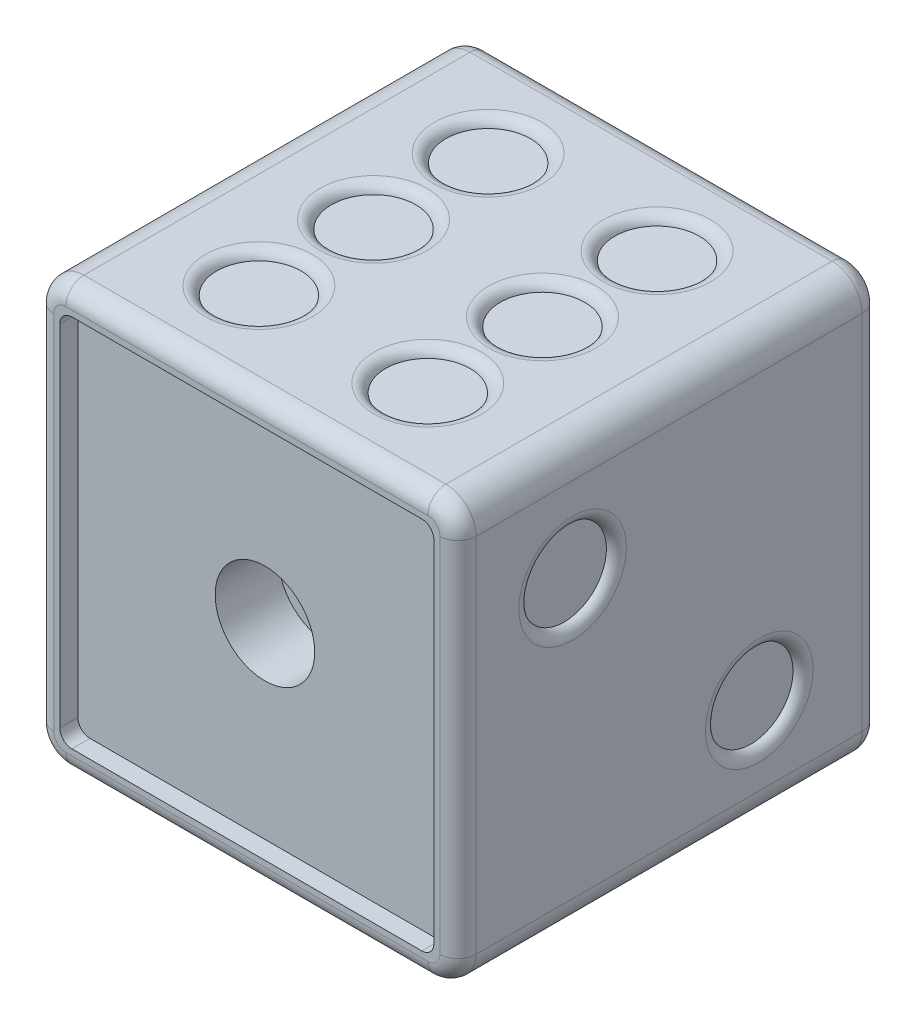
ISO-10303-21;
HEADER;
FILE_DESCRIPTION(('STEP AP214'),'2;1');
FILE_NAME('part.step','',(''),(''),'','','');
FILE_SCHEMA(('AUTOMOTIVE_DESIGN { 1 0 10303 214 1 1 1 1 }'));
ENDSEC;
DATA;
#1=APPLICATION_CONTEXT('core data for automotive mechanical design processes');
#2=APPLICATION_PROTOCOL_DEFINITION('international standard','automotive_design',2000,#1);
#3=PRODUCT_CONTEXT('',#1,'mechanical');
#4=PRODUCT('Part','Part','',(#3));
#5=PRODUCT_RELATED_PRODUCT_CATEGORY('part','',(#4));
#6=PRODUCT_DEFINITION_FORMATION('','',#4);
#7=PRODUCT_DEFINITION_CONTEXT('part definition',#1,'design');
#8=PRODUCT_DEFINITION('design','',#6,#7);
#9=PRODUCT_DEFINITION_SHAPE('','',#8);
#10=(LENGTH_UNIT() NAMED_UNIT(*) SI_UNIT(.MILLI.,.METRE.));
#11=(NAMED_UNIT(*) PLANE_ANGLE_UNIT() SI_UNIT($,.RADIAN.));
#12=(NAMED_UNIT(*) SI_UNIT($,.STERADIAN.) SOLID_ANGLE_UNIT());
#13=UNCERTAINTY_MEASURE_WITH_UNIT(LENGTH_MEASURE(1.E-05),#10,'distance_accuracy_value','');
#14=(GEOMETRIC_REPRESENTATION_CONTEXT(3) GLOBAL_UNCERTAINTY_ASSIGNED_CONTEXT((#13)) GLOBAL_UNIT_ASSIGNED_CONTEXT((#10,
#11,#12)) REPRESENTATION_CONTEXT('',''));
#15=CARTESIAN_POINT('',(0.,0.,0.));
#16=DIRECTION('',(0.,0.,1.));
#17=DIRECTION('',(1.,0.,0.));
#18=AXIS2_PLACEMENT_3D('',#15,#16,#17);
#19=CARTESIAN_POINT('',(-17.5,-17.5,35.));
#20=DIRECTION('',(1.,0.,0.));
#21=DIRECTION('',(0.,0.,-1.));
#22=AXIS2_PLACEMENT_3D('',#19,#20,#21);
#23=PLANE('',#22);
#24=CARTESIAN_POINT('',(-17.5,-8.49896049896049,24.9677754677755));
#25=DIRECTION('',(1.,0.,0.));
#26=DIRECTION('',(0.,0.,-1.));
#27=AXIS2_PLACEMENT_3D('',#24,#25,#26);
#28=CIRCLE('',#27,4.45393920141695);
#29=CARTESIAN_POINT('',(-17.5,-8.49896049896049,20.5138362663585));
#30=VERTEX_POINT('',#29);
#31=EDGE_CURVE('E420',#30,#30,#28,.T.);
#32=ORIENTED_EDGE('',*,*,#31,.T.);
#33=EDGE_LOOP('',(#32));
#34=FACE_BOUND('',#33,.T.);
#35=CARTESIAN_POINT('',(-17.5,0.,17.5));
#36=DIRECTION('',(1.,0.,0.));
#37=DIRECTION('',(0.,0.,-1.));
#38=AXIS2_PLACEMENT_3D('',#35,#36,#37);
#39=CIRCLE('',#38,4.45393920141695);
#40=CARTESIAN_POINT('',(-17.5,0.,13.0460607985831));
#41=VERTEX_POINT('',#40);
#42=EDGE_CURVE('E417',#41,#41,#39,.T.);
#43=ORIENTED_EDGE('',*,*,#42,.T.);
#44=EDGE_LOOP('',(#43));
#45=FACE_BOUND('',#44,.T.);
#46=CARTESIAN_POINT('',(-17.5,8.00000000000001,9.5));
#47=DIRECTION('',(1.,0.,0.));
#48=DIRECTION('',(0.,0.,-1.));
#49=AXIS2_PLACEMENT_3D('',#46,#47,#48);
#50=CIRCLE('',#49,4.45393920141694);
#51=CARTESIAN_POINT('',(-17.5,8.00000000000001,5.04606079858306));
#52=VERTEX_POINT('',#51);
#53=EDGE_CURVE('E414',#52,#52,#50,.T.);
#54=ORIENTED_EDGE('',*,*,#53,.T.);
#55=EDGE_LOOP('',(#54));
#56=FACE_BOUND('',#55,.T.);
#57=DIRECTION('',(0.,0.,-1.));
#58=VECTOR('',#57,1.);
#59=CARTESIAN_POINT('',(-17.5,-15.,35.));
#60=LINE('',#59,#58);
#61=CARTESIAN_POINT('',(-17.5,-15.,1.5));
#62=VERTEX_POINT('',#61);
#63=CARTESIAN_POINT('',(-17.5,-15.,33.5));
#64=VERTEX_POINT('',#63);
#65=EDGE_CURVE('E276',#62,#64,#60,.F.);
#66=ORIENTED_EDGE('',*,*,#65,.T.);
#67=DIRECTION('',(0.,-1.,0.));
#68=VECTOR('',#67,1.);
#69=CARTESIAN_POINT('',(-17.5,15.,33.5));
#70=LINE('',#69,#68);
#71=CARTESIAN_POINT('',(-17.5,15.,33.5));
#72=VERTEX_POINT('',#71);
#73=EDGE_CURVE('E325',#64,#72,#70,.F.);
#74=ORIENTED_EDGE('',*,*,#73,.T.);
#75=DIRECTION('',(0.,0.,-1.));
#76=VECTOR('',#75,1.);
#77=CARTESIAN_POINT('',(-17.5,15.,35.));
#78=LINE('',#77,#76);
#79=CARTESIAN_POINT('',(-17.5,15.,1.5));
#80=VERTEX_POINT('',#79);
#81=EDGE_CURVE('E279',#72,#80,#78,.T.);
#82=ORIENTED_EDGE('',*,*,#81,.T.);
#83=DIRECTION('',(0.,-1.,0.));
#84=VECTOR('',#83,1.);
#85=CARTESIAN_POINT('',(-17.5,-17.5,1.5));
#86=LINE('',#85,#84);
#87=EDGE_CURVE('E323',#80,#62,#86,.T.);
#88=ORIENTED_EDGE('',*,*,#87,.T.);
#89=EDGE_LOOP('',(#66,#74,#82,#88));
#90=FACE_BOUND('',#89,.T.);
#91=ADVANCED_FACE('F47',(#34,#45,#56,#90),#23,.F.);
#92=CARTESIAN_POINT('',(17.5,-17.5,35.));
#93=DIRECTION('',(0.,1.,0.));
#94=DIRECTION('',(-1.,0.,0.));
#95=AXIS2_PLACEMENT_3D('',#92,#93,#94);
#96=PLANE('',#95);
#97=CARTESIAN_POINT('',(0.,-17.5,17.5));
#98=DIRECTION('',(0.,1.,0.));
#99=DIRECTION('',(-1.,0.,0.));
#100=AXIS2_PLACEMENT_3D('',#97,#98,#99);
#101=CIRCLE('',#100,4.45393920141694);
#102=CARTESIAN_POINT('',(-4.45393920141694,-17.5,17.5));
#103=VERTEX_POINT('',#102);
#104=EDGE_CURVE('E366',#103,#103,#101,.T.);
#105=ORIENTED_EDGE('',*,*,#104,.T.);
#106=EDGE_LOOP('',(#105));
#107=FACE_BOUND('',#106,.T.);
#108=DIRECTION('',(0.,0.,-1.));
#109=VECTOR('',#108,1.);
#110=CARTESIAN_POINT('',(15.,-17.5,35.));
#111=LINE('',#110,#109);
#112=CARTESIAN_POINT('',(15.,-17.5,1.5));
#113=VERTEX_POINT('',#112);
#114=CARTESIAN_POINT('',(15.,-17.5,33.5));
#115=VERTEX_POINT('',#114);
#116=EDGE_CURVE('E297',#113,#115,#111,.F.);
#117=ORIENTED_EDGE('',*,*,#116,.T.);
#118=DIRECTION('',(1.,0.,0.));
#119=VECTOR('',#118,1.);
#120=CARTESIAN_POINT('',(-15.,-17.5,33.5));
#121=LINE('',#120,#119);
#122=CARTESIAN_POINT('',(-15.,-17.5,33.5));
#123=VERTEX_POINT('',#122);
#124=EDGE_CURVE('E364',#115,#123,#121,.F.);
#125=ORIENTED_EDGE('',*,*,#124,.T.);
#126=DIRECTION('',(0.,0.,-1.));
#127=VECTOR('',#126,1.);
#128=CARTESIAN_POINT('',(-15.,-17.5,35.));
#129=LINE('',#128,#127);
#130=CARTESIAN_POINT('',(-15.,-17.5,1.5));
#131=VERTEX_POINT('',#130);
#132=EDGE_CURVE('E294',#123,#131,#129,.T.);
#133=ORIENTED_EDGE('',*,*,#132,.T.);
#134=DIRECTION('',(1.,0.,0.));
#135=VECTOR('',#134,1.);
#136=CARTESIAN_POINT('',(17.5,-17.5,1.5));
#137=LINE('',#136,#135);
#138=EDGE_CURVE('E362',#131,#113,#137,.T.);
#139=ORIENTED_EDGE('',*,*,#138,.T.);
#140=EDGE_LOOP('',(#117,#125,#133,#139));
#141=FACE_BOUND('',#140,.T.);
#142=ADVANCED_FACE('F562',(#107,#141),#96,.F.);
#143=CARTESIAN_POINT('',(17.5,-17.5,35.));
#144=DIRECTION('',(-1.,0.,0.));
#145=DIRECTION('',(0.,-1.,0.));
#146=AXIS2_PLACEMENT_3D('',#143,#144,#145);
#147=PLANE('',#146);
#148=CARTESIAN_POINT('',(17.5,-8.4989604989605,10.0322245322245));
#149=DIRECTION('',(-1.,0.,0.));
#150=DIRECTION('',(0.,-1.,0.));
#151=AXIS2_PLACEMENT_3D('',#148,#149,#150);
#152=CIRCLE('',#151,4.45393920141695);
#153=CARTESIAN_POINT('',(17.5,-12.9528997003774,10.0322245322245));
#154=VERTEX_POINT('',#153);
#155=EDGE_CURVE('E11',#154,#154,#152,.T.);
#156=ORIENTED_EDGE('',*,*,#155,.T.);
#157=EDGE_LOOP('',(#156));
#158=FACE_BOUND('',#157,.T.);
#159=CARTESIAN_POINT('',(17.5,8.,25.5));
#160=DIRECTION('',(-1.,0.,0.));
#161=DIRECTION('',(0.,-1.,0.));
#162=AXIS2_PLACEMENT_3D('',#159,#160,#161);
#163=CIRCLE('',#162,4.45393920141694);
#164=CARTESIAN_POINT('',(17.5,3.54606079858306,25.5));
#165=VERTEX_POINT('',#164);
#166=EDGE_CURVE('E55',#165,#165,#163,.T.);
#167=ORIENTED_EDGE('',*,*,#166,.T.);
#168=EDGE_LOOP('',(#167));
#169=FACE_BOUND('',#168,.T.);
#170=DIRECTION('',(0.,0.,-1.));
#171=VECTOR('',#170,1.);
#172=CARTESIAN_POINT('',(17.5,15.,35.));
#173=LINE('',#172,#171);
#174=CARTESIAN_POINT('',(17.5,15.,1.5));
#175=VERTEX_POINT('',#174);
#176=CARTESIAN_POINT('',(17.5,15.,33.5));
#177=VERTEX_POINT('',#176);
#178=EDGE_CURVE('E291',#175,#177,#173,.F.);
#179=ORIENTED_EDGE('',*,*,#178,.T.);
#180=DIRECTION('',(0.,1.,0.));
#181=VECTOR('',#180,1.);
#182=CARTESIAN_POINT('',(17.5,-15.,33.5));
#183=LINE('',#182,#181);
#184=CARTESIAN_POINT('',(17.5,-15.,33.5));
#185=VERTEX_POINT('',#184);
#186=EDGE_CURVE('E341',#177,#185,#183,.F.);
#187=ORIENTED_EDGE('',*,*,#186,.T.);
#188=DIRECTION('',(0.,0.,-1.));
#189=VECTOR('',#188,1.);
#190=CARTESIAN_POINT('',(17.5,-15.,35.));
#191=LINE('',#190,#189);
#192=CARTESIAN_POINT('',(17.5,-15.,1.5));
#193=VERTEX_POINT('',#192);
#194=EDGE_CURVE('E288',#185,#193,#191,.T.);
#195=ORIENTED_EDGE('',*,*,#194,.T.);
#196=DIRECTION('',(0.,1.,0.));
#197=VECTOR('',#196,1.);
#198=CARTESIAN_POINT('',(17.5,-17.5,1.5));
#199=LINE('',#198,#197);
#200=EDGE_CURVE('E339',#193,#175,#199,.T.);
#201=ORIENTED_EDGE('',*,*,#200,.T.);
#202=EDGE_LOOP('',(#179,#187,#195,#201));
#203=FACE_BOUND('',#202,.T.);
#204=ADVANCED_FACE('F458',(#158,#169,#203),#147,.F.);
#205=CARTESIAN_POINT('',(17.5,17.5,35.));
#206=DIRECTION('',(0.,-1.,0.));
#207=DIRECTION('',(1.,0.,0.));
#208=AXIS2_PLACEMENT_3D('',#205,#206,#207);
#209=PLANE('',#208);
#210=CARTESIAN_POINT('',(-7.00000000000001,17.5,8.));
#211=DIRECTION('',(0.,-1.,0.));
#212=DIRECTION('',(1.,0.,0.));
#213=AXIS2_PLACEMENT_3D('',#210,#211,#212);
#214=CIRCLE('',#213,4.45393920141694);
#215=CARTESIAN_POINT('',(-2.54606079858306,17.5,8.));
#216=VERTEX_POINT('',#215);
#217=EDGE_CURVE('E438',#216,#216,#214,.T.);
#218=ORIENTED_EDGE('',*,*,#217,.T.);
#219=EDGE_LOOP('',(#218));
#220=FACE_BOUND('',#219,.T.);
#221=CARTESIAN_POINT('',(7.,17.5,8.));
#222=DIRECTION('',(0.,-1.,0.));
#223=DIRECTION('',(1.,0.,0.));
#224=AXIS2_PLACEMENT_3D('',#221,#222,#223);
#225=CIRCLE('',#224,4.45393920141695);
#226=CARTESIAN_POINT('',(11.4539392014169,17.5,8.));
#227=VERTEX_POINT('',#226);
#228=EDGE_CURVE('E435',#227,#227,#225,.T.);
#229=ORIENTED_EDGE('',*,*,#228,.T.);
#230=EDGE_LOOP('',(#229));
#231=FACE_BOUND('',#230,.T.);
#232=CARTESIAN_POINT('',(-7.,17.5,17.5));
#233=DIRECTION('',(0.,-1.,0.));
#234=DIRECTION('',(1.,0.,0.));
#235=AXIS2_PLACEMENT_3D('',#232,#233,#234);
#236=CIRCLE('',#235,4.45393920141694);
#237=CARTESIAN_POINT('',(-2.54606079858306,17.5,17.5));
#238=VERTEX_POINT('',#237);
#239=EDGE_CURVE('E432',#238,#238,#236,.T.);
#240=ORIENTED_EDGE('',*,*,#239,.T.);
#241=EDGE_LOOP('',(#240));
#242=FACE_BOUND('',#241,.T.);
#243=CARTESIAN_POINT('',(7.,17.5,17.5));
#244=DIRECTION('',(0.,-1.,0.));
#245=DIRECTION('',(1.,0.,0.));
#246=AXIS2_PLACEMENT_3D('',#243,#244,#245);
#247=CIRCLE('',#246,4.45393920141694);
#248=CARTESIAN_POINT('',(11.4539392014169,17.5,17.5));
#249=VERTEX_POINT('',#248);
#250=EDGE_CURVE('E429',#249,#249,#247,.T.);
#251=ORIENTED_EDGE('',*,*,#250,.T.);
#252=EDGE_LOOP('',(#251));
#253=FACE_BOUND('',#252,.T.);
#254=CARTESIAN_POINT('',(-7.00000000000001,17.5,27.));
#255=DIRECTION('',(0.,-1.,0.));
#256=DIRECTION('',(1.,0.,0.));
#257=AXIS2_PLACEMENT_3D('',#254,#255,#256);
#258=CIRCLE('',#257,4.45393920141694);
#259=CARTESIAN_POINT('',(-2.54606079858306,17.5,27.));
#260=VERTEX_POINT('',#259);
#261=EDGE_CURVE('E426',#260,#260,#258,.T.);
#262=ORIENTED_EDGE('',*,*,#261,.T.);
#263=EDGE_LOOP('',(#262));
#264=FACE_BOUND('',#263,.T.);
#265=CARTESIAN_POINT('',(7.00000000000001,17.5,27.));
#266=DIRECTION('',(0.,-1.,0.));
#267=DIRECTION('',(1.,0.,0.));
#268=AXIS2_PLACEMENT_3D('',#265,#266,#267);
#269=CIRCLE('',#268,4.45393920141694);
#270=CARTESIAN_POINT('',(11.453939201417,17.5,27.));
#271=VERTEX_POINT('',#270);
#272=EDGE_CURVE('E423',#271,#271,#269,.T.);
#273=ORIENTED_EDGE('',*,*,#272,.T.);
#274=EDGE_LOOP('',(#273));
#275=FACE_BOUND('',#274,.T.);
#276=DIRECTION('',(0.,0.,-1.));
#277=VECTOR('',#276,1.);
#278=CARTESIAN_POINT('',(-15.,17.5,35.));
#279=LINE('',#278,#277);
#280=CARTESIAN_POINT('',(-15.,17.5,1.5));
#281=VERTEX_POINT('',#280);
#282=CARTESIAN_POINT('',(-15.,17.5,33.5));
#283=VERTEX_POINT('',#282);
#284=EDGE_CURVE('E285',#281,#283,#279,.F.);
#285=ORIENTED_EDGE('',*,*,#284,.T.);
#286=DIRECTION('',(-1.,0.,0.));
#287=VECTOR('',#286,1.);
#288=CARTESIAN_POINT('',(15.,17.5,33.5));
#289=LINE('',#288,#287);
#290=CARTESIAN_POINT('',(15.,17.5,33.5));
#291=VERTEX_POINT('',#290);
#292=EDGE_CURVE('E333',#283,#291,#289,.F.);
#293=ORIENTED_EDGE('',*,*,#292,.T.);
#294=DIRECTION('',(0.,0.,-1.));
#295=VECTOR('',#294,1.);
#296=CARTESIAN_POINT('',(15.,17.5,35.));
#297=LINE('',#296,#295);
#298=CARTESIAN_POINT('',(15.,17.5,1.5));
#299=VERTEX_POINT('',#298);
#300=EDGE_CURVE('E282',#291,#299,#297,.T.);
#301=ORIENTED_EDGE('',*,*,#300,.T.);
#302=DIRECTION('',(-1.,0.,0.));
#303=VECTOR('',#302,1.);
#304=CARTESIAN_POINT('',(17.5,17.5,1.5));
#305=LINE('',#304,#303);
#306=EDGE_CURVE('E331',#299,#281,#305,.T.);
#307=ORIENTED_EDGE('',*,*,#306,.T.);
#308=EDGE_LOOP('',(#285,#293,#301,#307));
#309=FACE_BOUND('',#308,.T.);
#310=ADVANCED_FACE('F574',(#220,#231,#242,#253,#264,#275,#309),#209,.F.);
#311=CARTESIAN_POINT('',(0.,0.,35.));
#312=DIRECTION('',(0.,0.,1.));
#313=DIRECTION('',(1.,0.,0.));
#314=AXIS2_PLACEMENT_3D('',#311,#312,#313);
#315=PLANE('',#314);
#316=DIRECTION('',(0.,-1.,0.));
#317=VECTOR('',#316,1.);
#318=CARTESIAN_POINT('',(-16.,-15.,35.));
#319=LINE('',#318,#317);
#320=CARTESIAN_POINT('',(-16.,15.,35.));
#321=VERTEX_POINT('',#320);
#322=CARTESIAN_POINT('',(-16.,-15.,35.));
#323=VERTEX_POINT('',#322);
#324=EDGE_CURVE('E312',#321,#323,#319,.T.);
#325=ORIENTED_EDGE('',*,*,#324,.T.);
#326=CARTESIAN_POINT('',(-15.,-15.,35.));
#327=DIRECTION('',(0.,0.,1.));
#328=DIRECTION('',(1.,0.,0.));
#329=AXIS2_PLACEMENT_3D('',#326,#327,#328);
#330=CIRCLE('',#329,1.);
#331=CARTESIAN_POINT('',(-15.,-16.,35.));
#332=VERTEX_POINT('',#331);
#333=EDGE_CURVE('E314',#323,#332,#330,.T.);
#334=ORIENTED_EDGE('',*,*,#333,.T.);
#335=DIRECTION('',(1.,0.,0.));
#336=VECTOR('',#335,1.);
#337=CARTESIAN_POINT('',(15.,-16.,35.));
#338=LINE('',#337,#336);
#339=CARTESIAN_POINT('',(15.,-16.,35.));
#340=VERTEX_POINT('',#339);
#341=EDGE_CURVE('E300',#332,#340,#338,.T.);
#342=ORIENTED_EDGE('',*,*,#341,.T.);
#343=CARTESIAN_POINT('',(15.,-15.,35.));
#344=DIRECTION('',(0.,0.,1.));
#345=DIRECTION('',(1.,0.,0.));
#346=AXIS2_PLACEMENT_3D('',#343,#344,#345);
#347=CIRCLE('',#346,1.);
#348=CARTESIAN_POINT('',(16.,-15.,35.));
#349=VERTEX_POINT('',#348);
#350=EDGE_CURVE('E302',#340,#349,#347,.T.);
#351=ORIENTED_EDGE('',*,*,#350,.T.);
#352=DIRECTION('',(0.,1.,0.));
#353=VECTOR('',#352,1.);
#354=CARTESIAN_POINT('',(16.,15.,35.));
#355=LINE('',#354,#353);
#356=CARTESIAN_POINT('',(16.,15.,35.));
#357=VERTEX_POINT('',#356);
#358=EDGE_CURVE('E304',#349,#357,#355,.T.);
#359=ORIENTED_EDGE('',*,*,#358,.T.);
#360=CARTESIAN_POINT('',(15.,15.,35.));
#361=DIRECTION('',(0.,0.,1.));
#362=DIRECTION('',(1.,0.,0.));
#363=AXIS2_PLACEMENT_3D('',#360,#361,#362);
#364=CIRCLE('',#363,1.);
#365=CARTESIAN_POINT('',(15.,16.,35.));
#366=VERTEX_POINT('',#365);
#367=EDGE_CURVE('E306',#357,#366,#364,.T.);
#368=ORIENTED_EDGE('',*,*,#367,.T.);
#369=DIRECTION('',(-1.,0.,0.));
#370=VECTOR('',#369,1.);
#371=CARTESIAN_POINT('',(-15.,16.,35.));
#372=LINE('',#371,#370);
#373=CARTESIAN_POINT('',(-15.,16.,35.));
#374=VERTEX_POINT('',#373);
#375=EDGE_CURVE('E308',#366,#374,#372,.T.);
#376=ORIENTED_EDGE('',*,*,#375,.T.);
#377=CARTESIAN_POINT('',(-15.,15.,35.));
#378=DIRECTION('',(0.,0.,1.));
#379=DIRECTION('',(1.,0.,0.));
#380=AXIS2_PLACEMENT_3D('',#377,#378,#379);
#381=CIRCLE('',#380,1.);
#382=EDGE_CURVE('E310',#374,#321,#381,.T.);
#383=ORIENTED_EDGE('',*,*,#382,.T.);
#384=EDGE_LOOP('',(#325,#334,#342,#351,#359,#368,#376,#383));
#385=FACE_BOUND('',#384,.T.);
#386=DIRECTION('',(0.,-1.,0.));
#387=VECTOR('',#386,1.);
#388=CARTESIAN_POINT('',(-15.5,-15.5,35.));
#389=LINE('',#388,#387);
#390=CARTESIAN_POINT('',(-15.5,14.5,35.));
#391=VERTEX_POINT('',#390);
#392=CARTESIAN_POINT('',(-15.5,-14.5,35.));
#393=VERTEX_POINT('',#392);
#394=EDGE_CURVE('E237',#391,#393,#389,.T.);
#395=ORIENTED_EDGE('',*,*,#394,.F.);
#396=CARTESIAN_POINT('',(-14.5,14.5,35.));
#397=DIRECTION('',(0.,0.,1.));
#398=DIRECTION('',(1.,0.,0.));
#399=AXIS2_PLACEMENT_3D('',#396,#397,#398);
#400=CIRCLE('',#399,1.);
#401=CARTESIAN_POINT('',(-14.5,15.5,35.));
#402=VERTEX_POINT('',#401);
#403=EDGE_CURVE('E274',#391,#402,#400,.F.);
#404=ORIENTED_EDGE('',*,*,#403,.T.);
#405=DIRECTION('',(-1.,0.,0.));
#406=VECTOR('',#405,1.);
#407=CARTESIAN_POINT('',(15.5,15.5,35.));
#408=LINE('',#407,#406);
#409=CARTESIAN_POINT('',(14.5,15.5,35.));
#410=VERTEX_POINT('',#409);
#411=EDGE_CURVE('E240',#410,#402,#408,.T.);
#412=ORIENTED_EDGE('',*,*,#411,.F.);
#413=CARTESIAN_POINT('',(14.5,14.5,35.));
#414=DIRECTION('',(0.,0.,1.));
#415=DIRECTION('',(1.,0.,0.));
#416=AXIS2_PLACEMENT_3D('',#413,#414,#415);
#417=CIRCLE('',#416,1.);
#418=CARTESIAN_POINT('',(15.5,14.5,35.));
#419=VERTEX_POINT('',#418);
#420=EDGE_CURVE('E272',#410,#419,#417,.F.);
#421=ORIENTED_EDGE('',*,*,#420,.T.);
#422=DIRECTION('',(0.,1.,0.));
#423=VECTOR('',#422,1.);
#424=CARTESIAN_POINT('',(15.5,-15.5,35.));
#425=LINE('',#424,#423);
#426=CARTESIAN_POINT('',(15.5,-14.5,35.));
#427=VERTEX_POINT('',#426);
#428=EDGE_CURVE('E236',#427,#419,#425,.T.);
#429=ORIENTED_EDGE('',*,*,#428,.F.);
#430=CARTESIAN_POINT('',(14.5,-14.5,35.));
#431=DIRECTION('',(0.,0.,1.));
#432=DIRECTION('',(1.,0.,0.));
#433=AXIS2_PLACEMENT_3D('',#430,#431,#432);
#434=CIRCLE('',#433,1.);
#435=CARTESIAN_POINT('',(14.5,-15.5,35.));
#436=VERTEX_POINT('',#435);
#437=EDGE_CURVE('E220',#427,#436,#434,.F.);
#438=ORIENTED_EDGE('',*,*,#437,.T.);
#439=DIRECTION('',(1.,0.,0.));
#440=VECTOR('',#439,1.);
#441=CARTESIAN_POINT('',(15.5,-15.5,35.));
#442=LINE('',#441,#440);
#443=CARTESIAN_POINT('',(-14.5,-15.5,35.));
#444=VERTEX_POINT('',#443);
#445=EDGE_CURVE('E227',#444,#436,#442,.T.);
#446=ORIENTED_EDGE('',*,*,#445,.F.);
#447=CARTESIAN_POINT('',(-14.5,-14.5,35.));
#448=DIRECTION('',(0.,0.,1.));
#449=DIRECTION('',(1.,0.,0.));
#450=AXIS2_PLACEMENT_3D('',#447,#448,#449);
#451=CIRCLE('',#450,1.);
#452=EDGE_CURVE('E210',#444,#393,#451,.F.);
#453=ORIENTED_EDGE('',*,*,#452,.T.);
#454=EDGE_LOOP('',(#395,#404,#412,#421,#429,#438,#446,#453));
#455=FACE_BOUND('',#454,.T.);
#456=ADVANCED_FACE('F234',(#385,#455),#315,.T.);
#457=CARTESIAN_POINT('',(0.,0.,0.));
#458=DIRECTION('',(0.,0.,1.));
#459=DIRECTION('',(1.,0.,0.));
#460=AXIS2_PLACEMENT_3D('',#457,#458,#459);
#461=PLANE('',#460);
#462=CARTESIAN_POINT('',(-8.00000000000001,9.00000000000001,0.));
#463=DIRECTION('',(0.,0.,1.));
#464=DIRECTION('',(1.,0.,0.));
#465=AXIS2_PLACEMENT_3D('',#462,#463,#464);
#466=CIRCLE('',#465,4.45393920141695);
#467=CARTESIAN_POINT('',(-3.54606079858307,9.00000000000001,0.));
#468=VERTEX_POINT('',#467);
#469=EDGE_CURVE('E453',#468,#468,#466,.T.);
#470=ORIENTED_EDGE('',*,*,#469,.T.);
#471=EDGE_LOOP('',(#470));
#472=FACE_BOUND('',#471,.T.);
#473=CARTESIAN_POINT('',(-8.00000000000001,-9.,0.));
#474=DIRECTION('',(0.,0.,1.));
#475=DIRECTION('',(1.,0.,0.));
#476=AXIS2_PLACEMENT_3D('',#473,#474,#475);
#477=CIRCLE('',#476,4.45393920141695);
#478=CARTESIAN_POINT('',(-3.54606079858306,-9.,0.));
#479=VERTEX_POINT('',#478);
#480=EDGE_CURVE('E450',#479,#479,#477,.T.);
#481=ORIENTED_EDGE('',*,*,#480,.T.);
#482=EDGE_LOOP('',(#481));
#483=FACE_BOUND('',#482,.T.);
#484=CARTESIAN_POINT('',(0.,0.,0.));
#485=DIRECTION('',(0.,0.,1.));
#486=DIRECTION('',(1.,0.,0.));
#487=AXIS2_PLACEMENT_3D('',#484,#485,#486);
#488=CIRCLE('',#487,4.45393920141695);
#489=CARTESIAN_POINT('',(4.45393920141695,0.,0.));
#490=VERTEX_POINT('',#489);
#491=EDGE_CURVE('E447',#490,#490,#488,.T.);
#492=ORIENTED_EDGE('',*,*,#491,.T.);
#493=EDGE_LOOP('',(#492));
#494=FACE_BOUND('',#493,.T.);
#495=CARTESIAN_POINT('',(8.00000000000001,9.00000000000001,0.));
#496=DIRECTION('',(0.,0.,1.));
#497=DIRECTION('',(1.,0.,0.));
#498=AXIS2_PLACEMENT_3D('',#495,#496,#497);
#499=CIRCLE('',#498,4.45393920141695);
#500=CARTESIAN_POINT('',(12.453939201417,9.00000000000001,0.));
#501=VERTEX_POINT('',#500);
#502=EDGE_CURVE('E444',#501,#501,#499,.T.);
#503=ORIENTED_EDGE('',*,*,#502,.T.);
#504=EDGE_LOOP('',(#503));
#505=FACE_BOUND('',#504,.T.);
#506=CARTESIAN_POINT('',(8.00000000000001,-9.,0.));
#507=DIRECTION('',(0.,0.,1.));
#508=DIRECTION('',(1.,0.,0.));
#509=AXIS2_PLACEMENT_3D('',#506,#507,#508);
#510=CIRCLE('',#509,4.45393920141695);
#511=CARTESIAN_POINT('',(12.453939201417,-9.,0.));
#512=VERTEX_POINT('',#511);
#513=EDGE_CURVE('E441',#512,#512,#510,.T.);
#514=ORIENTED_EDGE('',*,*,#513,.T.);
#515=EDGE_LOOP('',(#514));
#516=FACE_BOUND('',#515,.T.);
#517=DIRECTION('',(1.,0.,0.));
#518=VECTOR('',#517,1.);
#519=CARTESIAN_POINT('',(0.,-16.,0.));
#520=LINE('',#519,#518);
#521=CARTESIAN_POINT('',(15.,-16.,0.));
#522=VERTEX_POINT('',#521);
#523=CARTESIAN_POINT('',(-15.,-16.,0.));
#524=VERTEX_POINT('',#523);
#525=EDGE_CURVE('E347',#522,#524,#520,.F.);
#526=ORIENTED_EDGE('',*,*,#525,.T.);
#527=CARTESIAN_POINT('',(-15.,-15.,0.));
#528=DIRECTION('',(0.,0.,1.));
#529=DIRECTION('',(1.,0.,0.));
#530=AXIS2_PLACEMENT_3D('',#527,#528,#529);
#531=CIRCLE('',#530,1.);
#532=CARTESIAN_POINT('',(-16.,-15.,0.));
#533=VERTEX_POINT('',#532);
#534=EDGE_CURVE('E360',#524,#533,#531,.F.);
#535=ORIENTED_EDGE('',*,*,#534,.T.);
#536=DIRECTION('',(0.,-1.,0.));
#537=VECTOR('',#536,1.);
#538=CARTESIAN_POINT('',(-16.,0.,0.));
#539=LINE('',#538,#537);
#540=CARTESIAN_POINT('',(-16.,15.,0.));
#541=VERTEX_POINT('',#540);
#542=EDGE_CURVE('E69',#533,#541,#539,.F.);
#543=ORIENTED_EDGE('',*,*,#542,.T.);
#544=CARTESIAN_POINT('',(-15.,15.,0.));
#545=DIRECTION('',(0.,0.,1.));
#546=DIRECTION('',(1.,0.,0.));
#547=AXIS2_PLACEMENT_3D('',#544,#545,#546);
#548=CIRCLE('',#547,1.);
#549=CARTESIAN_POINT('',(-15.,16.,0.));
#550=VERTEX_POINT('',#549);
#551=EDGE_CURVE('E357',#541,#550,#548,.F.);
#552=ORIENTED_EDGE('',*,*,#551,.T.);
#553=DIRECTION('',(-1.,0.,0.));
#554=VECTOR('',#553,1.);
#555=CARTESIAN_POINT('',(0.,16.,0.));
#556=LINE('',#555,#554);
#557=CARTESIAN_POINT('',(15.,16.,0.));
#558=VERTEX_POINT('',#557);
#559=EDGE_CURVE('E355',#550,#558,#556,.F.);
#560=ORIENTED_EDGE('',*,*,#559,.T.);
#561=CARTESIAN_POINT('',(15.,15.,0.));
#562=DIRECTION('',(0.,0.,1.));
#563=DIRECTION('',(1.,0.,0.));
#564=AXIS2_PLACEMENT_3D('',#561,#562,#563);
#565=CIRCLE('',#564,1.);
#566=CARTESIAN_POINT('',(16.,15.,0.));
#567=VERTEX_POINT('',#566);
#568=EDGE_CURVE('E353',#558,#567,#565,.F.);
#569=ORIENTED_EDGE('',*,*,#568,.T.);
#570=DIRECTION('',(0.,1.,0.));
#571=VECTOR('',#570,1.);
#572=CARTESIAN_POINT('',(16.,0.,0.));
#573=LINE('',#572,#571);
#574=CARTESIAN_POINT('',(16.,-15.,0.));
#575=VERTEX_POINT('',#574);
#576=EDGE_CURVE('E351',#567,#575,#573,.F.);
#577=ORIENTED_EDGE('',*,*,#576,.T.);
#578=CARTESIAN_POINT('',(15.,-15.,0.));
#579=DIRECTION('',(0.,0.,1.));
#580=DIRECTION('',(1.,0.,0.));
#581=AXIS2_PLACEMENT_3D('',#578,#579,#580);
#582=CIRCLE('',#581,1.);
#583=EDGE_CURVE('E349',#575,#522,#582,.F.);
#584=ORIENTED_EDGE('',*,*,#583,.T.);
#585=EDGE_LOOP('',(#526,#535,#543,#552,#560,#569,#577,#584));
#586=FACE_BOUND('',#585,.T.);
#587=ADVANCED_FACE('F579',(#472,#483,#494,#505,#516,#586),#461,.F.);
#588=CARTESIAN_POINT('',(-15.5,-15.5,33.5));
#589=DIRECTION('',(-1.,0.,0.));
#590=DIRECTION('',(0.,0.,1.));
#591=AXIS2_PLACEMENT_3D('',#588,#589,#590);
#592=PLANE('',#591);
#593=ORIENTED_EDGE('',*,*,#394,.T.);
#594=DIRECTION('',(0.,0.,1.));
#595=VECTOR('',#594,1.);
#596=CARTESIAN_POINT('',(-15.5,-14.5,33.5));
#597=LINE('',#596,#595);
#598=CARTESIAN_POINT('',(-15.5,-14.5,33.5));
#599=VERTEX_POINT('',#598);
#600=EDGE_CURVE('E215',#393,#599,#597,.F.);
#601=ORIENTED_EDGE('',*,*,#600,.T.);
#602=DIRECTION('',(0.,-1.,0.));
#603=VECTOR('',#602,1.);
#604=CARTESIAN_POINT('',(-15.5,-15.5,33.5));
#605=LINE('',#604,#603);
#606=CARTESIAN_POINT('',(-15.5,14.5,33.5));
#607=VERTEX_POINT('',#606);
#608=EDGE_CURVE('E248',#607,#599,#605,.T.);
#609=ORIENTED_EDGE('',*,*,#608,.F.);
#610=DIRECTION('',(0.,0.,1.));
#611=VECTOR('',#610,1.);
#612=CARTESIAN_POINT('',(-15.5,14.5,35.));
#613=LINE('',#612,#611);
#614=EDGE_CURVE('E231',#607,#391,#613,.T.);
#615=ORIENTED_EDGE('',*,*,#614,.T.);
#616=EDGE_LOOP('',(#593,#601,#609,#615));
#617=FACE_BOUND('',#616,.T.);
#618=ADVANCED_FACE('F540',(#617),#592,.F.);
#619=CARTESIAN_POINT('',(15.5,15.5,33.5));
#620=DIRECTION('',(0.,1.,0.));
#621=DIRECTION('',(-1.,0.,0.));
#622=AXIS2_PLACEMENT_3D('',#619,#620,#621);
#623=PLANE('',#622);
#624=DIRECTION('',(-1.,0.,0.));
#625=VECTOR('',#624,1.);
#626=CARTESIAN_POINT('',(15.5,15.5,33.5));
#627=LINE('',#626,#625);
#628=CARTESIAN_POINT('',(14.5,15.5,33.5));
#629=VERTEX_POINT('',#628);
#630=CARTESIAN_POINT('',(-14.5,15.5,33.5));
#631=VERTEX_POINT('',#630);
#632=EDGE_CURVE('E249',#629,#631,#627,.T.);
#633=ORIENTED_EDGE('',*,*,#632,.F.);
#634=DIRECTION('',(0.,0.,1.));
#635=VECTOR('',#634,1.);
#636=CARTESIAN_POINT('',(14.5,15.5,35.));
#637=LINE('',#636,#635);
#638=EDGE_CURVE('E221',#629,#410,#637,.T.);
#639=ORIENTED_EDGE('',*,*,#638,.T.);
#640=ORIENTED_EDGE('',*,*,#411,.T.);
#641=DIRECTION('',(0.,0.,1.));
#642=VECTOR('',#641,1.);
#643=CARTESIAN_POINT('',(-14.5,15.5,33.5));
#644=LINE('',#643,#642);
#645=EDGE_CURVE('E267',#402,#631,#644,.F.);
#646=ORIENTED_EDGE('',*,*,#645,.T.);
#647=EDGE_LOOP('',(#633,#639,#640,#646));
#648=FACE_BOUND('',#647,.T.);
#649=ADVANCED_FACE('F542',(#648),#623,.F.);
#650=CARTESIAN_POINT('',(15.5,-15.5,33.5));
#651=DIRECTION('',(1.,0.,0.));
#652=DIRECTION('',(0.,0.,-1.));
#653=AXIS2_PLACEMENT_3D('',#650,#651,#652);
#654=PLANE('',#653);
#655=DIRECTION('',(0.,1.,0.));
#656=VECTOR('',#655,1.);
#657=CARTESIAN_POINT('',(15.5,-15.5,33.5));
#658=LINE('',#657,#656);
#659=CARTESIAN_POINT('',(15.5,-14.5,33.5));
#660=VERTEX_POINT('',#659);
#661=CARTESIAN_POINT('',(15.5,14.5,33.5));
#662=VERTEX_POINT('',#661);
#663=EDGE_CURVE('E524',#660,#662,#658,.T.);
#664=ORIENTED_EDGE('',*,*,#663,.F.);
#665=DIRECTION('',(0.,0.,1.));
#666=VECTOR('',#665,1.);
#667=CARTESIAN_POINT('',(15.5,-14.5,35.));
#668=LINE('',#667,#666);
#669=EDGE_CURVE('E264',#660,#427,#668,.T.);
#670=ORIENTED_EDGE('',*,*,#669,.T.);
#671=ORIENTED_EDGE('',*,*,#428,.T.);
#672=DIRECTION('',(0.,0.,1.));
#673=VECTOR('',#672,1.);
#674=CARTESIAN_POINT('',(15.5,14.5,33.5));
#675=LINE('',#674,#673);
#676=EDGE_CURVE('E262',#419,#662,#675,.F.);
#677=ORIENTED_EDGE('',*,*,#676,.T.);
#678=EDGE_LOOP('',(#664,#670,#671,#677));
#679=FACE_BOUND('',#678,.T.);
#680=ADVANCED_FACE('F548',(#679),#654,.F.);
#681=CARTESIAN_POINT('',(15.5,-15.5,33.5));
#682=DIRECTION('',(0.,-1.,0.));
#683=DIRECTION('',(1.,0.,0.));
#684=AXIS2_PLACEMENT_3D('',#681,#682,#683);
#685=PLANE('',#684);
#686=DIRECTION('',(1.,0.,0.));
#687=VECTOR('',#686,1.);
#688=CARTESIAN_POINT('',(15.5,-15.5,33.5));
#689=LINE('',#688,#687);
#690=CARTESIAN_POINT('',(-14.5,-15.5,33.5));
#691=VERTEX_POINT('',#690);
#692=CARTESIAN_POINT('',(14.5,-15.5,33.5));
#693=VERTEX_POINT('',#692);
#694=EDGE_CURVE('E230',#691,#693,#689,.T.);
#695=ORIENTED_EDGE('',*,*,#694,.F.);
#696=DIRECTION('',(0.,0.,1.));
#697=VECTOR('',#696,1.);
#698=CARTESIAN_POINT('',(-14.5,-15.5,35.));
#699=LINE('',#698,#697);
#700=EDGE_CURVE('E214',#691,#444,#699,.T.);
#701=ORIENTED_EDGE('',*,*,#700,.T.);
#702=ORIENTED_EDGE('',*,*,#445,.T.);
#703=DIRECTION('',(0.,0.,1.));
#704=VECTOR('',#703,1.);
#705=CARTESIAN_POINT('',(14.5,-15.5,33.5));
#706=LINE('',#705,#704);
#707=EDGE_CURVE('E232',#436,#693,#706,.F.);
#708=ORIENTED_EDGE('',*,*,#707,.T.);
#709=EDGE_LOOP('',(#695,#701,#702,#708));
#710=FACE_BOUND('',#709,.T.);
#711=ADVANCED_FACE('F226',(#710),#685,.F.);
#712=CARTESIAN_POINT('',(0.,0.,33.5));
#713=DIRECTION('',(0.,0.,1.));
#714=DIRECTION('',(1.,0.,0.));
#715=AXIS2_PLACEMENT_3D('',#712,#713,#714);
#716=PLANE('',#715);
#717=CARTESIAN_POINT('',(0.,0.,33.5));
#718=DIRECTION('',(0.,0.,1.));
#719=DIRECTION('',(1.,0.,0.));
#720=AXIS2_PLACEMENT_3D('',#717,#718,#719);
#721=CIRCLE('',#720,4.125);
#722=CARTESIAN_POINT('',(4.125,0.,33.5));
#723=VERTEX_POINT('',#722);
#724=EDGE_CURVE('E390',#723,#723,#721,.T.);
#725=ORIENTED_EDGE('',*,*,#724,.F.);
#726=EDGE_LOOP('',(#725));
#727=FACE_BOUND('',#726,.T.);
#728=ORIENTED_EDGE('',*,*,#608,.T.);
#729=CARTESIAN_POINT('',(-14.5,-14.5,33.5));
#730=DIRECTION('',(0.,0.,1.));
#731=DIRECTION('',(1.,0.,0.));
#732=AXIS2_PLACEMENT_3D('',#729,#730,#731);
#733=CIRCLE('',#732,1.);
#734=EDGE_CURVE('E260',#599,#691,#733,.T.);
#735=ORIENTED_EDGE('',*,*,#734,.T.);
#736=ORIENTED_EDGE('',*,*,#694,.T.);
#737=CARTESIAN_POINT('',(14.5,-14.5,33.5));
#738=DIRECTION('',(0.,0.,1.));
#739=DIRECTION('',(1.,0.,0.));
#740=AXIS2_PLACEMENT_3D('',#737,#738,#739);
#741=CIRCLE('',#740,1.);
#742=EDGE_CURVE('E258',#693,#660,#741,.T.);
#743=ORIENTED_EDGE('',*,*,#742,.T.);
#744=ORIENTED_EDGE('',*,*,#663,.T.);
#745=CARTESIAN_POINT('',(14.5,14.5,33.5));
#746=DIRECTION('',(0.,0.,1.));
#747=DIRECTION('',(1.,0.,0.));
#748=AXIS2_PLACEMENT_3D('',#745,#746,#747);
#749=CIRCLE('',#748,1.);
#750=EDGE_CURVE('E256',#662,#629,#749,.T.);
#751=ORIENTED_EDGE('',*,*,#750,.T.);
#752=ORIENTED_EDGE('',*,*,#632,.T.);
#753=CARTESIAN_POINT('',(-14.5,14.5,33.5));
#754=DIRECTION('',(0.,0.,1.));
#755=DIRECTION('',(1.,0.,0.));
#756=AXIS2_PLACEMENT_3D('',#753,#754,#755);
#757=CIRCLE('',#756,1.);
#758=EDGE_CURVE('E254',#631,#607,#757,.T.);
#759=ORIENTED_EDGE('',*,*,#758,.T.);
#760=EDGE_LOOP('',(#728,#735,#736,#743,#744,#751,#752,#759));
#761=FACE_BOUND('',#760,.T.);
#762=ADVANCED_FACE('F530',(#727,#761),#716,.T.);
#763=CARTESIAN_POINT('',(-14.5,-14.5,33.5));
#764=DIRECTION('',(0.,0.,-1.));
#765=DIRECTION('',(-1.,0.,0.));
#766=AXIS2_PLACEMENT_3D('',#763,#764,#765);
#767=CYLINDRICAL_SURFACE('',#766,1.);
#768=ORIENTED_EDGE('',*,*,#734,.F.);
#769=ORIENTED_EDGE('',*,*,#600,.F.);
#770=ORIENTED_EDGE('',*,*,#452,.F.);
#771=ORIENTED_EDGE('',*,*,#700,.F.);
#772=EDGE_LOOP('',(#768,#769,#770,#771));
#773=FACE_BOUND('',#772,.T.);
#774=ADVANCED_FACE('F213',(#773),#767,.F.);
#775=CARTESIAN_POINT('',(14.5,-14.5,33.5));
#776=DIRECTION('',(0.,0.,-1.));
#777=DIRECTION('',(-1.,0.,0.));
#778=AXIS2_PLACEMENT_3D('',#775,#776,#777);
#779=CYLINDRICAL_SURFACE('',#778,1.);
#780=ORIENTED_EDGE('',*,*,#742,.F.);
#781=ORIENTED_EDGE('',*,*,#707,.F.);
#782=ORIENTED_EDGE('',*,*,#437,.F.);
#783=ORIENTED_EDGE('',*,*,#669,.F.);
#784=EDGE_LOOP('',(#780,#781,#782,#783));
#785=FACE_BOUND('',#784,.T.);
#786=ADVANCED_FACE('F552',(#785),#779,.F.);
#787=CARTESIAN_POINT('',(14.5,14.5,33.5));
#788=DIRECTION('',(0.,0.,-1.));
#789=DIRECTION('',(-1.,0.,0.));
#790=AXIS2_PLACEMENT_3D('',#787,#788,#789);
#791=CYLINDRICAL_SURFACE('',#790,1.);
#792=ORIENTED_EDGE('',*,*,#750,.F.);
#793=ORIENTED_EDGE('',*,*,#676,.F.);
#794=ORIENTED_EDGE('',*,*,#420,.F.);
#795=ORIENTED_EDGE('',*,*,#638,.F.);
#796=EDGE_LOOP('',(#792,#793,#794,#795));
#797=FACE_BOUND('',#796,.T.);
#798=ADVANCED_FACE('F544',(#797),#791,.F.);
#799=CARTESIAN_POINT('',(-14.5,14.5,33.5));
#800=DIRECTION('',(0.,0.,-1.));
#801=DIRECTION('',(-1.,0.,0.));
#802=AXIS2_PLACEMENT_3D('',#799,#800,#801);
#803=CYLINDRICAL_SURFACE('',#802,1.);
#804=ORIENTED_EDGE('',*,*,#758,.F.);
#805=ORIENTED_EDGE('',*,*,#645,.F.);
#806=ORIENTED_EDGE('',*,*,#403,.F.);
#807=ORIENTED_EDGE('',*,*,#614,.F.);
#808=EDGE_LOOP('',(#804,#805,#806,#807));
#809=FACE_BOUND('',#808,.T.);
#810=ADVANCED_FACE('F538',(#809),#803,.F.);
#811=CARTESIAN_POINT('',(0.,0.,28.25));
#812=DIRECTION('',(0.,0.,1.));
#813=DIRECTION('',(1.,0.,0.));
#814=AXIS2_PLACEMENT_3D('',#811,#812,#813);
#815=CYLINDRICAL_SURFACE('',#814,4.125);
#816=CARTESIAN_POINT('',(0.,0.,28.25));
#817=DIRECTION('',(0.,0.,1.));
#818=DIRECTION('',(1.,0.,0.));
#819=AXIS2_PLACEMENT_3D('',#816,#817,#818);
#820=CIRCLE('',#819,4.125);
#821=CARTESIAN_POINT('',(4.125,0.,28.25));
#822=VERTEX_POINT('',#821);
#823=EDGE_CURVE('E242',#822,#822,#820,.T.);
#824=CARTESIAN_POINT('',(4.125,0.,28.25));
#825=CARTESIAN_POINT('',(4.125,0.,28.3046875));
#826=CARTESIAN_POINT('',(4.125,0.,28.359375));
#827=CARTESIAN_POINT('',(4.125,0.,28.46875));
#828=CARTESIAN_POINT('',(4.125,0.,28.5234375));
#829=CARTESIAN_POINT('',(4.125,0.,28.6328125));
#830=CARTESIAN_POINT('',(4.125,0.,28.6875));
#831=CARTESIAN_POINT('',(4.125,0.,28.796875));
#832=CARTESIAN_POINT('',(4.125,0.,28.8515625));
#833=CARTESIAN_POINT('',(4.125,0.,28.9609375));
#834=CARTESIAN_POINT('',(4.125,0.,29.015625));
#835=CARTESIAN_POINT('',(4.125,0.,29.125));
#836=CARTESIAN_POINT('',(4.125,0.,29.1796875));
#837=CARTESIAN_POINT('',(4.125,0.,29.2890625));
#838=CARTESIAN_POINT('',(4.125,0.,29.34375));
#839=CARTESIAN_POINT('',(4.125,0.,29.453125));
#840=CARTESIAN_POINT('',(4.125,0.,29.5078125));
#841=CARTESIAN_POINT('',(4.125,0.,29.6171875));
#842=CARTESIAN_POINT('',(4.125,0.,29.671875));
#843=CARTESIAN_POINT('',(4.125,0.,29.78125));
#844=CARTESIAN_POINT('',(4.125,0.,29.8359375));
#845=CARTESIAN_POINT('',(4.125,0.,29.9453125));
#846=CARTESIAN_POINT('',(4.125,0.,30.));
#847=CARTESIAN_POINT('',(4.125,0.,30.109375));
#848=CARTESIAN_POINT('',(4.125,0.,30.1640625));
#849=CARTESIAN_POINT('',(4.125,0.,30.2734375));
#850=CARTESIAN_POINT('',(4.125,0.,30.328125));
#851=CARTESIAN_POINT('',(4.125,0.,30.4375));
#852=CARTESIAN_POINT('',(4.125,0.,30.4921875));
#853=CARTESIAN_POINT('',(4.125,0.,30.6015625));
#854=CARTESIAN_POINT('',(4.125,0.,30.65625));
#855=CARTESIAN_POINT('',(4.125,0.,30.765625));
#856=CARTESIAN_POINT('',(4.125,0.,30.8203125));
#857=CARTESIAN_POINT('',(4.125,0.,30.9296875));
#858=CARTESIAN_POINT('',(4.125,0.,30.984375));
#859=CARTESIAN_POINT('',(4.125,0.,31.09375));
#860=CARTESIAN_POINT('',(4.125,0.,31.1484375));
#861=CARTESIAN_POINT('',(4.125,0.,31.2578125));
#862=CARTESIAN_POINT('',(4.125,0.,31.3125));
#863=CARTESIAN_POINT('',(4.125,0.,31.421875));
#864=CARTESIAN_POINT('',(4.125,0.,31.4765625));
#865=CARTESIAN_POINT('',(4.125,0.,31.5859375));
#866=CARTESIAN_POINT('',(4.125,0.,31.640625));
#867=CARTESIAN_POINT('',(4.125,0.,31.75));
#868=CARTESIAN_POINT('',(4.125,0.,31.8046875));
#869=CARTESIAN_POINT('',(4.125,0.,31.9140625));
#870=CARTESIAN_POINT('',(4.125,0.,31.96875));
#871=CARTESIAN_POINT('',(4.125,0.,32.078125));
#872=CARTESIAN_POINT('',(4.125,0.,32.1328125));
#873=CARTESIAN_POINT('',(4.125,0.,32.2421875));
#874=CARTESIAN_POINT('',(4.125,0.,32.296875));
#875=CARTESIAN_POINT('',(4.125,0.,32.40625));
#876=CARTESIAN_POINT('',(4.125,0.,32.4609375));
#877=CARTESIAN_POINT('',(4.125,0.,32.5703125));
#878=CARTESIAN_POINT('',(4.125,0.,32.625));
#879=CARTESIAN_POINT('',(4.125,0.,32.734375));
#880=CARTESIAN_POINT('',(4.125,0.,32.7890625));
#881=CARTESIAN_POINT('',(4.125,0.,32.8984375));
#882=CARTESIAN_POINT('',(4.125,0.,32.953125));
#883=CARTESIAN_POINT('',(4.125,0.,33.0625));
#884=CARTESIAN_POINT('',(4.125,0.,33.1171875));
#885=CARTESIAN_POINT('',(4.125,0.,33.2265625));
#886=CARTESIAN_POINT('',(4.125,0.,33.28125));
#887=CARTESIAN_POINT('',(4.125,0.,33.390625));
#888=CARTESIAN_POINT('',(4.125,0.,33.4453125));
#889=CARTESIAN_POINT('',(4.125,0.,33.5));
#890=B_SPLINE_CURVE_WITH_KNOTS('',3,(#824,#825,#826,#827,#828,#829,#830,#831,#832,#833,#834,
#835,#836,#837,#838,#839,#840,#841,#842,#843,#844,#845,#846,#847,#848,#849,#850,#851,#852,#853,
#854,#855,#856,#857,#858,#859,#860,#861,#862,#863,#864,#865,#866,#867,#868,#869,#870,#871,#872,
#873,#874,#875,#876,#877,#878,#879,#880,#881,#882,#883,#884,#885,#886,#887,#888,#889),
.UNSPECIFIED.,.F.,.F.,(4,2,2,2,2,2,2,2,2,2,2,2,2,2,2,2,2,2,2,2,2,2,2,2,2,2,2,2,2,2,2,2,4),(0.,
0.164062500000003,0.328125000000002,0.492187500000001,0.656250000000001,0.8203125,
0.984375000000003,1.1484375,1.3125,1.4765625,1.640625,1.8046875,1.96875,2.1328125,2.296875,
2.4609375,2.625,2.7890625,2.953125,3.1171875,3.28125,3.4453125,3.609375,3.7734375,3.9375,
4.1015625,4.265625,4.4296875,4.59375,4.7578125,4.921875,5.0859375,5.25),.UNSPECIFIED.);
#891=EDGE_CURVE('BSEAM597',#822,#723,#890,.T.);
#892=ORIENTED_EDGE('',*,*,#823,.F.);
#893=ORIENTED_EDGE('',*,*,#724,.T.);
#894=ORIENTED_EDGE('',*,*,#891,.T.);
#895=ORIENTED_EDGE('',*,*,#891,.F.);
#896=EDGE_LOOP('',(#892,#894,#893,#895));
#897=FACE_BOUND('',#896,.T.);
#898=ADVANCED_FACE('F597',(#897),#815,.F.);
#899=CARTESIAN_POINT('',(0.,0.,28.25));
#900=DIRECTION('',(0.,0.,1.));
#901=DIRECTION('',(1.,0.,0.));
#902=AXIS2_PLACEMENT_3D('',#899,#900,#901);
#903=PLANE('',#902);
#904=ORIENTED_EDGE('',*,*,#823,.T.);
#905=EDGE_LOOP('',(#904));
#906=FACE_BOUND('',#905,.T.);
#907=ADVANCED_FACE('F600',(#906),#903,.T.);
#908=CARTESIAN_POINT('',(-15.,15.,35.));
#909=DIRECTION('',(0.,0.,-1.));
#910=DIRECTION('',(-1.,0.,0.));
#911=AXIS2_PLACEMENT_3D('',#908,#909,#910);
#912=CYLINDRICAL_SURFACE('',#911,2.5);
#913=ORIENTED_EDGE('',*,*,#81,.F.);
#914=CARTESIAN_POINT('',(-15.,15.,33.5));
#915=DIRECTION('',(0.,0.,1.));
#916=DIRECTION('',(1.,0.,0.));
#917=AXIS2_PLACEMENT_3D('',#914,#915,#916);
#918=CIRCLE('',#917,2.5);
#919=EDGE_CURVE('E329',#72,#283,#918,.F.);
#920=ORIENTED_EDGE('',*,*,#919,.T.);
#921=ORIENTED_EDGE('',*,*,#284,.F.);
#922=CARTESIAN_POINT('',(-15.,15.,1.5));
#923=DIRECTION('',(0.,0.,1.));
#924=DIRECTION('',(1.,0.,0.));
#925=AXIS2_PLACEMENT_3D('',#922,#923,#924);
#926=CIRCLE('',#925,2.5);
#927=EDGE_CURVE('E327',#281,#80,#926,.T.);
#928=ORIENTED_EDGE('',*,*,#927,.T.);
#929=EDGE_LOOP('',(#913,#920,#921,#928));
#930=FACE_BOUND('',#929,.T.);
#931=ADVANCED_FACE('F604',(#930),#912,.T.);
#932=CARTESIAN_POINT('',(15.,15.,35.));
#933=DIRECTION('',(0.,0.,-1.));
#934=DIRECTION('',(-1.,0.,0.));
#935=AXIS2_PLACEMENT_3D('',#932,#933,#934);
#936=CYLINDRICAL_SURFACE('',#935,2.5);
#937=ORIENTED_EDGE('',*,*,#300,.F.);
#938=CARTESIAN_POINT('',(15.,15.,33.5));
#939=DIRECTION('',(0.,0.,1.));
#940=DIRECTION('',(1.,0.,0.));
#941=AXIS2_PLACEMENT_3D('',#938,#939,#940);
#942=CIRCLE('',#941,2.5);
#943=EDGE_CURVE('E337',#291,#177,#942,.F.);
#944=ORIENTED_EDGE('',*,*,#943,.T.);
#945=ORIENTED_EDGE('',*,*,#178,.F.);
#946=CARTESIAN_POINT('',(15.,15.,1.5));
#947=DIRECTION('',(0.,0.,1.));
#948=DIRECTION('',(1.,0.,0.));
#949=AXIS2_PLACEMENT_3D('',#946,#947,#948);
#950=CIRCLE('',#949,2.5);
#951=EDGE_CURVE('E335',#175,#299,#950,.T.);
#952=ORIENTED_EDGE('',*,*,#951,.T.);
#953=EDGE_LOOP('',(#937,#944,#945,#952));
#954=FACE_BOUND('',#953,.T.);
#955=ADVANCED_FACE('F1122',(#954),#936,.T.);
#956=CARTESIAN_POINT('',(15.,-15.,35.));
#957=DIRECTION('',(0.,0.,-1.));
#958=DIRECTION('',(-1.,0.,0.));
#959=AXIS2_PLACEMENT_3D('',#956,#957,#958);
#960=CYLINDRICAL_SURFACE('',#959,2.5);
#961=ORIENTED_EDGE('',*,*,#194,.F.);
#962=CARTESIAN_POINT('',(15.,-15.,33.5));
#963=DIRECTION('',(0.,0.,1.));
#964=DIRECTION('',(1.,0.,0.));
#965=AXIS2_PLACEMENT_3D('',#962,#963,#964);
#966=CIRCLE('',#965,2.5);
#967=EDGE_CURVE('E345',#185,#115,#966,.F.);
#968=ORIENTED_EDGE('',*,*,#967,.T.);
#969=ORIENTED_EDGE('',*,*,#116,.F.);
#970=CARTESIAN_POINT('',(15.,-15.,1.5));
#971=DIRECTION('',(0.,0.,1.));
#972=DIRECTION('',(1.,0.,0.));
#973=AXIS2_PLACEMENT_3D('',#970,#971,#972);
#974=CIRCLE('',#973,2.5);
#975=EDGE_CURVE('E343',#113,#193,#974,.T.);
#976=ORIENTED_EDGE('',*,*,#975,.T.);
#977=EDGE_LOOP('',(#961,#968,#969,#976));
#978=FACE_BOUND('',#977,.T.);
#979=ADVANCED_FACE('F1112',(#978),#960,.T.);
#980=CARTESIAN_POINT('',(-15.,-15.,35.));
#981=DIRECTION('',(0.,0.,-1.));
#982=DIRECTION('',(-1.,0.,0.));
#983=AXIS2_PLACEMENT_3D('',#980,#981,#982);
#984=CYLINDRICAL_SURFACE('',#983,2.5);
#985=ORIENTED_EDGE('',*,*,#132,.F.);
#986=CARTESIAN_POINT('',(-15.,-15.,33.5));
#987=DIRECTION('',(0.,0.,1.));
#988=DIRECTION('',(1.,0.,0.));
#989=AXIS2_PLACEMENT_3D('',#986,#987,#988);
#990=CIRCLE('',#989,2.5);
#991=EDGE_CURVE('E320',#123,#64,#990,.F.);
#992=ORIENTED_EDGE('',*,*,#991,.T.);
#993=ORIENTED_EDGE('',*,*,#65,.F.);
#994=CARTESIAN_POINT('',(-15.,-15.,1.5));
#995=DIRECTION('',(0.,0.,1.));
#996=DIRECTION('',(1.,0.,0.));
#997=AXIS2_PLACEMENT_3D('',#994,#995,#996);
#998=CIRCLE('',#997,2.5);
#999=EDGE_CURVE('E317',#62,#131,#998,.T.);
#1000=ORIENTED_EDGE('',*,*,#999,.T.);
#1001=EDGE_LOOP('',(#985,#992,#993,#1000));
#1002=FACE_BOUND('',#1001,.T.);
#1003=ADVANCED_FACE('F1101',(#1002),#984,.T.);
#1004=CARTESIAN_POINT('',(15.,15.,33.5));
#1005=DIRECTION('',(0.,0.,1.));
#1006=DIRECTION('',(1.,0.,0.));
#1007=AXIS2_PLACEMENT_3D('',#1004,#1005,#1006);
#1008=DEGENERATE_TOROIDAL_SURFACE('',#1007,1.,1.5,.T.);
#1009=CARTESIAN_POINT('',(16.,15.,33.5));
#1010=DIRECTION('',(0.,-1.,0.));
#1011=DIRECTION('',(1.,0.,0.));
#1012=AXIS2_PLACEMENT_3D('',#1009,#1010,#1011);
#1013=CIRCLE('',#1012,1.5);
#1014=EDGE_CURVE('E384',#177,#357,#1013,.T.);
#1015=ORIENTED_EDGE('',*,*,#1014,.F.);
#1016=ORIENTED_EDGE('',*,*,#943,.F.);
#1017=CARTESIAN_POINT('',(15.,16.,33.5));
#1018=DIRECTION('',(-1.,0.,0.));
#1019=DIRECTION('',(0.,0.,1.));
#1020=AXIS2_PLACEMENT_3D('',#1017,#1018,#1019);
#1021=CIRCLE('',#1020,1.5);
#1022=EDGE_CURVE('E387',#366,#291,#1021,.T.);
#1023=ORIENTED_EDGE('',*,*,#1022,.F.);
#1024=ORIENTED_EDGE('',*,*,#367,.F.);
#1025=EDGE_LOOP('',(#1015,#1016,#1023,#1024));
#1026=FACE_BOUND('',#1025,.T.);
#1027=ADVANCED_FACE('F1091',(#1026),#1008,.T.);
#1028=CARTESIAN_POINT('',(0.,16.,33.5));
#1029=DIRECTION('',(1.,0.,0.));
#1030=DIRECTION('',(0.,1.,0.));
#1031=AXIS2_PLACEMENT_3D('',#1028,#1029,#1030);
#1032=CYLINDRICAL_SURFACE('',#1031,1.5);
#1033=ORIENTED_EDGE('',*,*,#1022,.T.);
#1034=ORIENTED_EDGE('',*,*,#292,.F.);
#1035=CARTESIAN_POINT('',(-15.,16.,33.5));
#1036=DIRECTION('',(-1.,0.,0.));
#1037=DIRECTION('',(0.,-1.,0.));
#1038=AXIS2_PLACEMENT_3D('',#1035,#1036,#1037);
#1039=CIRCLE('',#1038,1.5);
#1040=EDGE_CURVE('E381',#374,#283,#1039,.T.);
#1041=ORIENTED_EDGE('',*,*,#1040,.F.);
#1042=ORIENTED_EDGE('',*,*,#375,.F.);
#1043=EDGE_LOOP('',(#1033,#1034,#1041,#1042));
#1044=FACE_BOUND('',#1043,.T.);
#1045=ADVANCED_FACE('F1081',(#1044),#1032,.T.);
#1046=CARTESIAN_POINT('',(16.,0.,33.5));
#1047=DIRECTION('',(0.,-1.,0.));
#1048=DIRECTION('',(1.,0.,0.));
#1049=AXIS2_PLACEMENT_3D('',#1046,#1047,#1048);
#1050=CYLINDRICAL_SURFACE('',#1049,1.5);
#1051=ORIENTED_EDGE('',*,*,#1014,.T.);
#1052=ORIENTED_EDGE('',*,*,#358,.F.);
#1053=CARTESIAN_POINT('',(16.,-15.,33.5));
#1054=DIRECTION('',(0.,-1.,0.));
#1055=DIRECTION('',(0.,0.,-1.));
#1056=AXIS2_PLACEMENT_3D('',#1053,#1054,#1055);
#1057=CIRCLE('',#1056,1.5);
#1058=EDGE_CURVE('E378',#185,#349,#1057,.T.);
#1059=ORIENTED_EDGE('',*,*,#1058,.F.);
#1060=ORIENTED_EDGE('',*,*,#186,.F.);
#1061=EDGE_LOOP('',(#1051,#1052,#1059,#1060));
#1062=FACE_BOUND('',#1061,.T.);
#1063=ADVANCED_FACE('F1070',(#1062),#1050,.T.);
#1064=CARTESIAN_POINT('',(-15.,15.,33.5));
#1065=DIRECTION('',(0.,0.,1.));
#1066=DIRECTION('',(1.,0.,0.));
#1067=AXIS2_PLACEMENT_3D('',#1064,#1065,#1066);
#1068=DEGENERATE_TOROIDAL_SURFACE('',#1067,1.,1.5,.T.);
#1069=ORIENTED_EDGE('',*,*,#1040,.T.);
#1070=ORIENTED_EDGE('',*,*,#919,.F.);
#1071=CARTESIAN_POINT('',(-16.,15.,33.5));
#1072=DIRECTION('',(0.,-1.,0.));
#1073=DIRECTION('',(0.,0.,-1.));
#1074=AXIS2_PLACEMENT_3D('',#1071,#1072,#1073);
#1075=CIRCLE('',#1074,1.5);
#1076=EDGE_CURVE('E375',#321,#72,#1075,.T.);
#1077=ORIENTED_EDGE('',*,*,#1076,.F.);
#1078=ORIENTED_EDGE('',*,*,#382,.F.);
#1079=EDGE_LOOP('',(#1069,#1070,#1077,#1078));
#1080=FACE_BOUND('',#1079,.T.);
#1081=ADVANCED_FACE('F1058',(#1080),#1068,.T.);
#1082=CARTESIAN_POINT('',(15.,-15.,33.5));
#1083=DIRECTION('',(0.,0.,1.));
#1084=DIRECTION('',(1.,0.,0.));
#1085=AXIS2_PLACEMENT_3D('',#1082,#1083,#1084);
#1086=DEGENERATE_TOROIDAL_SURFACE('',#1085,1.,1.5,.T.);
#1087=ORIENTED_EDGE('',*,*,#1058,.T.);
#1088=ORIENTED_EDGE('',*,*,#350,.F.);
#1089=CARTESIAN_POINT('',(15.,-16.,33.5));
#1090=DIRECTION('',(-1.,0.,0.));
#1091=DIRECTION('',(0.,0.,1.));
#1092=AXIS2_PLACEMENT_3D('',#1089,#1090,#1091);
#1093=CIRCLE('',#1092,1.5);
#1094=EDGE_CURVE('E372',#115,#340,#1093,.T.);
#1095=ORIENTED_EDGE('',*,*,#1094,.F.);
#1096=ORIENTED_EDGE('',*,*,#967,.F.);
#1097=EDGE_LOOP('',(#1087,#1088,#1095,#1096));
#1098=FACE_BOUND('',#1097,.T.);
#1099=ADVANCED_FACE('F1048',(#1098),#1086,.T.);
#1100=CARTESIAN_POINT('',(-16.,0.,33.5));
#1101=DIRECTION('',(0.,1.,0.));
#1102=DIRECTION('',(0.,0.,1.));
#1103=AXIS2_PLACEMENT_3D('',#1100,#1101,#1102);
#1104=CYLINDRICAL_SURFACE('',#1103,1.5);
#1105=ORIENTED_EDGE('',*,*,#1076,.T.);
#1106=ORIENTED_EDGE('',*,*,#73,.F.);
#1107=CARTESIAN_POINT('',(-16.,-15.,33.5));
#1108=DIRECTION('',(0.,-1.,0.));
#1109=DIRECTION('',(0.,0.,-1.));
#1110=AXIS2_PLACEMENT_3D('',#1107,#1108,#1109);
#1111=CIRCLE('',#1110,1.5);
#1112=EDGE_CURVE('E369',#323,#64,#1111,.T.);
#1113=ORIENTED_EDGE('',*,*,#1112,.F.);
#1114=ORIENTED_EDGE('',*,*,#324,.F.);
#1115=EDGE_LOOP('',(#1105,#1106,#1113,#1114));
#1116=FACE_BOUND('',#1115,.T.);
#1117=ADVANCED_FACE('F1038',(#1116),#1104,.T.);
#1118=CARTESIAN_POINT('',(0.,-16.,33.5));
#1119=DIRECTION('',(-1.,0.,0.));
#1120=DIRECTION('',(0.,-1.,0.));
#1121=AXIS2_PLACEMENT_3D('',#1118,#1119,#1120);
#1122=CYLINDRICAL_SURFACE('',#1121,1.5);
#1123=ORIENTED_EDGE('',*,*,#1094,.T.);
#1124=ORIENTED_EDGE('',*,*,#341,.F.);
#1125=CARTESIAN_POINT('',(-15.,-16.,33.5));
#1126=DIRECTION('',(-1.,0.,0.));
#1127=DIRECTION('',(0.,0.,1.));
#1128=AXIS2_PLACEMENT_3D('',#1125,#1126,#1127);
#1129=CIRCLE('',#1128,1.5);
#1130=EDGE_CURVE('E367',#123,#332,#1129,.T.);
#1131=ORIENTED_EDGE('',*,*,#1130,.F.);
#1132=ORIENTED_EDGE('',*,*,#124,.F.);
#1133=EDGE_LOOP('',(#1123,#1124,#1131,#1132));
#1134=FACE_BOUND('',#1133,.T.);
#1135=ADVANCED_FACE('F1026',(#1134),#1122,.T.);
#1136=CARTESIAN_POINT('',(-15.,-15.,33.5));
#1137=DIRECTION('',(0.,0.,1.));
#1138=DIRECTION('',(1.,0.,0.));
#1139=AXIS2_PLACEMENT_3D('',#1136,#1137,#1138);
#1140=DEGENERATE_TOROIDAL_SURFACE('',#1139,1.,1.5,.T.);
#1141=ORIENTED_EDGE('',*,*,#1112,.T.);
#1142=ORIENTED_EDGE('',*,*,#991,.F.);
#1143=ORIENTED_EDGE('',*,*,#1130,.T.);
#1144=ORIENTED_EDGE('',*,*,#333,.F.);
#1145=EDGE_LOOP('',(#1141,#1142,#1143,#1144));
#1146=FACE_BOUND('',#1145,.T.);
#1147=ADVANCED_FACE('F1015',(#1146),#1140,.T.);
#1148=CARTESIAN_POINT('',(15.,15.,1.5));
#1149=DIRECTION('',(0.,0.,1.));
#1150=DIRECTION('',(1.,0.,0.));
#1151=AXIS2_PLACEMENT_3D('',#1148,#1149,#1150);
#1152=DEGENERATE_TOROIDAL_SURFACE('',#1151,1.,1.5,.T.);
#1153=CARTESIAN_POINT('',(15.,16.,1.5));
#1154=DIRECTION('',(-1.,0.,0.));
#1155=DIRECTION('',(0.,0.,1.));
#1156=AXIS2_PLACEMENT_3D('',#1153,#1154,#1155);
#1157=CIRCLE('',#1156,1.5);
#1158=EDGE_CURVE('E407',#299,#558,#1157,.T.);
#1159=ORIENTED_EDGE('',*,*,#1158,.F.);
#1160=ORIENTED_EDGE('',*,*,#951,.F.);
#1161=CARTESIAN_POINT('',(16.,15.,1.5));
#1162=DIRECTION('',(0.,-1.,0.));
#1163=DIRECTION('',(1.,0.,0.));
#1164=AXIS2_PLACEMENT_3D('',#1161,#1162,#1163);
#1165=CIRCLE('',#1164,1.5);
#1166=EDGE_CURVE('E370',#567,#175,#1165,.T.);
#1167=ORIENTED_EDGE('',*,*,#1166,.F.);
#1168=ORIENTED_EDGE('',*,*,#568,.F.);
#1169=EDGE_LOOP('',(#1159,#1160,#1167,#1168));
#1170=FACE_BOUND('',#1169,.T.);
#1171=ADVANCED_FACE('F691',(#1170),#1152,.T.);
#1172=CARTESIAN_POINT('',(16.,-17.5,1.5));
#1173=DIRECTION('',(0.,1.,0.));
#1174=DIRECTION('',(-1.,0.,0.));
#1175=AXIS2_PLACEMENT_3D('',#1172,#1173,#1174);
#1176=CYLINDRICAL_SURFACE('',#1175,1.5);
#1177=ORIENTED_EDGE('',*,*,#1166,.T.);
#1178=ORIENTED_EDGE('',*,*,#200,.F.);
#1179=CARTESIAN_POINT('',(16.,-15.,1.5));
#1180=DIRECTION('',(0.,-1.,0.));
#1181=DIRECTION('',(0.,0.,-1.));
#1182=AXIS2_PLACEMENT_3D('',#1179,#1180,#1181);
#1183=CIRCLE('',#1182,1.5);
#1184=EDGE_CURVE('E404',#575,#193,#1183,.T.);
#1185=ORIENTED_EDGE('',*,*,#1184,.F.);
#1186=ORIENTED_EDGE('',*,*,#576,.F.);
#1187=EDGE_LOOP('',(#1177,#1178,#1185,#1186));
#1188=FACE_BOUND('',#1187,.T.);
#1189=ADVANCED_FACE('F997',(#1188),#1176,.T.);
#1190=CARTESIAN_POINT('',(17.5,16.,1.5));
#1191=DIRECTION('',(-1.,0.,0.));
#1192=DIRECTION('',(0.,-1.,0.));
#1193=AXIS2_PLACEMENT_3D('',#1190,#1191,#1192);
#1194=CYLINDRICAL_SURFACE('',#1193,1.5);
#1195=ORIENTED_EDGE('',*,*,#1158,.T.);
#1196=ORIENTED_EDGE('',*,*,#559,.F.);
#1197=CARTESIAN_POINT('',(-15.,16.,1.5));
#1198=DIRECTION('',(-1.,0.,0.));
#1199=DIRECTION('',(0.,0.,1.));
#1200=AXIS2_PLACEMENT_3D('',#1197,#1198,#1199);
#1201=CIRCLE('',#1200,1.5);
#1202=EDGE_CURVE('E401',#281,#550,#1201,.T.);
#1203=ORIENTED_EDGE('',*,*,#1202,.F.);
#1204=ORIENTED_EDGE('',*,*,#306,.F.);
#1205=EDGE_LOOP('',(#1195,#1196,#1203,#1204));
#1206=FACE_BOUND('',#1205,.T.);
#1207=ADVANCED_FACE('F986',(#1206),#1194,.T.);
#1208=CARTESIAN_POINT('',(15.,-15.,1.5));
#1209=DIRECTION('',(0.,0.,1.));
#1210=DIRECTION('',(1.,0.,0.));
#1211=AXIS2_PLACEMENT_3D('',#1208,#1209,#1210);
#1212=DEGENERATE_TOROIDAL_SURFACE('',#1211,1.,1.5,.T.);
#1213=ORIENTED_EDGE('',*,*,#1184,.T.);
#1214=ORIENTED_EDGE('',*,*,#975,.F.);
#1215=CARTESIAN_POINT('',(15.,-16.,1.5));
#1216=DIRECTION('',(-1.,0.,0.));
#1217=DIRECTION('',(0.,0.,1.));
#1218=AXIS2_PLACEMENT_3D('',#1215,#1216,#1217);
#1219=CIRCLE('',#1218,1.5);
#1220=EDGE_CURVE('E398',#522,#113,#1219,.T.);
#1221=ORIENTED_EDGE('',*,*,#1220,.F.);
#1222=ORIENTED_EDGE('',*,*,#583,.F.);
#1223=EDGE_LOOP('',(#1213,#1214,#1221,#1222));
#1224=FACE_BOUND('',#1223,.T.);
#1225=ADVANCED_FACE('F973',(#1224),#1212,.T.);
#1226=CARTESIAN_POINT('',(-15.,15.,1.5));
#1227=DIRECTION('',(0.,0.,1.));
#1228=DIRECTION('',(1.,0.,0.));
#1229=AXIS2_PLACEMENT_3D('',#1226,#1227,#1228);
#1230=DEGENERATE_TOROIDAL_SURFACE('',#1229,1.,1.5,.T.);
#1231=ORIENTED_EDGE('',*,*,#1202,.T.);
#1232=ORIENTED_EDGE('',*,*,#551,.F.);
#1233=CARTESIAN_POINT('',(-16.,15.,1.5));
#1234=DIRECTION('',(0.,-1.,0.));
#1235=DIRECTION('',(0.,0.,-1.));
#1236=AXIS2_PLACEMENT_3D('',#1233,#1234,#1235);
#1237=CIRCLE('',#1236,1.5);
#1238=EDGE_CURVE('E395',#80,#541,#1237,.T.);
#1239=ORIENTED_EDGE('',*,*,#1238,.F.);
#1240=ORIENTED_EDGE('',*,*,#927,.F.);
#1241=EDGE_LOOP('',(#1231,#1232,#1239,#1240));
#1242=FACE_BOUND('',#1241,.T.);
#1243=ADVANCED_FACE('F963',(#1242),#1230,.T.);
#1244=CARTESIAN_POINT('',(17.5,-16.,1.5));
#1245=DIRECTION('',(1.,0.,0.));
#1246=DIRECTION('',(0.,1.,0.));
#1247=AXIS2_PLACEMENT_3D('',#1244,#1245,#1246);
#1248=CYLINDRICAL_SURFACE('',#1247,1.5);
#1249=ORIENTED_EDGE('',*,*,#1220,.T.);
#1250=ORIENTED_EDGE('',*,*,#138,.F.);
#1251=CARTESIAN_POINT('',(-15.,-16.,1.5));
#1252=DIRECTION('',(-1.,0.,0.));
#1253=DIRECTION('',(0.,0.,1.));
#1254=AXIS2_PLACEMENT_3D('',#1251,#1252,#1253);
#1255=CIRCLE('',#1254,1.5);
#1256=EDGE_CURVE('E392',#524,#131,#1255,.T.);
#1257=ORIENTED_EDGE('',*,*,#1256,.F.);
#1258=ORIENTED_EDGE('',*,*,#525,.F.);
#1259=EDGE_LOOP('',(#1249,#1250,#1257,#1258));
#1260=FACE_BOUND('',#1259,.T.);
#1261=ADVANCED_FACE('F953',(#1260),#1248,.T.);
#1262=CARTESIAN_POINT('',(-16.,-17.5,1.5));
#1263=DIRECTION('',(0.,-1.,0.));
#1264=DIRECTION('',(0.,0.,-1.));
#1265=AXIS2_PLACEMENT_3D('',#1262,#1263,#1264);
#1266=CYLINDRICAL_SURFACE('',#1265,1.5);
#1267=ORIENTED_EDGE('',*,*,#1238,.T.);
#1268=ORIENTED_EDGE('',*,*,#542,.F.);
#1269=CARTESIAN_POINT('',(-16.,-15.,1.5));
#1270=DIRECTION('',(0.,-1.,0.));
#1271=DIRECTION('',(0.,0.,-1.));
#1272=AXIS2_PLACEMENT_3D('',#1269,#1270,#1271);
#1273=CIRCLE('',#1272,1.5);
#1274=EDGE_CURVE('E62',#62,#533,#1273,.T.);
#1275=ORIENTED_EDGE('',*,*,#1274,.F.);
#1276=ORIENTED_EDGE('',*,*,#87,.F.);
#1277=EDGE_LOOP('',(#1267,#1268,#1275,#1276));
#1278=FACE_BOUND('',#1277,.T.);
#1279=ADVANCED_FACE('F941',(#1278),#1266,.T.);
#1280=CARTESIAN_POINT('',(-15.,-15.,1.5));
#1281=DIRECTION('',(0.,0.,1.));
#1282=DIRECTION('',(1.,0.,0.));
#1283=AXIS2_PLACEMENT_3D('',#1280,#1281,#1282);
#1284=DEGENERATE_TOROIDAL_SURFACE('',#1283,1.,1.5,.T.);
#1285=ORIENTED_EDGE('',*,*,#1256,.T.);
#1286=ORIENTED_EDGE('',*,*,#999,.F.);
#1287=ORIENTED_EDGE('',*,*,#1274,.T.);
#1288=ORIENTED_EDGE('',*,*,#534,.F.);
#1289=EDGE_LOOP('',(#1285,#1286,#1287,#1288));
#1290=FACE_BOUND('',#1289,.T.);
#1291=ADVANCED_FACE('F610',(#1290),#1284,.T.);
#1292=CARTESIAN_POINT('',(0.,-16.8,17.5));
#1293=DIRECTION('',(0.,-1.,0.));
#1294=DIRECTION('',(1.,0.,0.));
#1295=AXIS2_PLACEMENT_3D('',#1292,#1293,#1294);
#1296=PLANE('',#1295);
#1297=CARTESIAN_POINT('',(0.,-16.8,17.5));
#1298=DIRECTION('',(0.,-1.,0.));
#1299=DIRECTION('',(1.,0.,0.));
#1300=AXIS2_PLACEMENT_3D('',#1297,#1298,#1299);
#1301=CIRCLE('',#1300,3.5);
#1302=CARTESIAN_POINT('',(3.5,-16.8,17.5));
#1303=VERTEX_POINT('',#1302);
#1304=EDGE_CURVE('E393',#1303,#1303,#1301,.T.);
#1305=ORIENTED_EDGE('',*,*,#1304,.T.);
#1306=EDGE_LOOP('',(#1305));
#1307=FACE_BOUND('',#1306,.T.);
#1308=ADVANCED_FACE('F606',(#1307),#1296,.T.);
#1309=CARTESIAN_POINT('',(0.,0.,0.7));
#1310=DIRECTION('',(0.,0.,-1.));
#1311=DIRECTION('',(-1.,0.,0.));
#1312=AXIS2_PLACEMENT_3D('',#1309,#1310,#1311);
#1313=PLANE('',#1312);
#1314=CARTESIAN_POINT('',(0.,0.,0.7));
#1315=DIRECTION('',(0.,0.,-1.));
#1316=DIRECTION('',(-1.,0.,0.));
#1317=AXIS2_PLACEMENT_3D('',#1314,#1315,#1316);
#1318=CIRCLE('',#1317,3.5);
#1319=CARTESIAN_POINT('',(-3.5,0.,0.7));
#1320=VERTEX_POINT('',#1319);
#1321=EDGE_CURVE('E504',#1320,#1320,#1318,.T.);
#1322=ORIENTED_EDGE('',*,*,#1321,.T.);
#1323=EDGE_LOOP('',(#1322));
#1324=FACE_BOUND('',#1323,.T.);
#1325=ADVANCED_FACE('F609',(#1324),#1313,.T.);
#1326=CARTESIAN_POINT('',(8.00000000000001,9.00000000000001,0.7));
#1327=DIRECTION('',(0.,0.,-1.));
#1328=DIRECTION('',(-1.,0.,0.));
#1329=AXIS2_PLACEMENT_3D('',#1326,#1327,#1328);
#1330=PLANE('',#1329);
#1331=CARTESIAN_POINT('',(8.00000000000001,9.00000000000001,0.7));
#1332=DIRECTION('',(0.,0.,-1.));
#1333=DIRECTION('',(-1.,0.,0.));
#1334=AXIS2_PLACEMENT_3D('',#1331,#1332,#1333);
#1335=CIRCLE('',#1334,3.5);
#1336=CARTESIAN_POINT('',(4.50000000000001,9.00000000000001,0.7));
#1337=VERTEX_POINT('',#1336);
#1338=EDGE_CURVE('E501',#1337,#1337,#1335,.T.);
#1339=ORIENTED_EDGE('',*,*,#1338,.T.);
#1340=EDGE_LOOP('',(#1339));
#1341=FACE_BOUND('',#1340,.T.);
#1342=ADVANCED_FACE('F614',(#1341),#1330,.T.);
#1343=CARTESIAN_POINT('',(8.00000000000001,-9.,0.7));
#1344=DIRECTION('',(0.,0.,1.));
#1345=DIRECTION('',(1.,0.,0.));
#1346=AXIS2_PLACEMENT_3D('',#1343,#1344,#1345);
#1347=PLANE('',#1346);
#1348=CARTESIAN_POINT('',(8.00000000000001,-9.,0.7));
#1349=DIRECTION('',(0.,0.,-1.));
#1350=DIRECTION('',(1.,0.,0.));
#1351=AXIS2_PLACEMENT_3D('',#1348,#1349,#1350);
#1352=CIRCLE('',#1351,3.5);
#1353=CARTESIAN_POINT('',(11.5,-9.,0.7));
#1354=VERTEX_POINT('',#1353);
#1355=EDGE_CURVE('E505',#1354,#1354,#1352,.T.);
#1356=ORIENTED_EDGE('',*,*,#1355,.T.);
#1357=EDGE_LOOP('',(#1356));
#1358=FACE_BOUND('',#1357,.T.);
#1359=ADVANCED_FACE('F624',(#1358),#1347,.F.);
#1360=CARTESIAN_POINT('',(-8.00000000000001,-9.,0.7));
#1361=DIRECTION('',(0.,0.,-1.));
#1362=DIRECTION('',(-1.,0.,0.));
#1363=AXIS2_PLACEMENT_3D('',#1360,#1361,#1362);
#1364=PLANE('',#1363);
#1365=CARTESIAN_POINT('',(-8.00000000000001,-9.,0.7));
#1366=DIRECTION('',(0.,0.,-1.));
#1367=DIRECTION('',(-1.,0.,0.));
#1368=AXIS2_PLACEMENT_3D('',#1365,#1366,#1367);
#1369=CIRCLE('',#1368,3.5);
#1370=CARTESIAN_POINT('',(-11.5,-9.,0.7));
#1371=VERTEX_POINT('',#1370);
#1372=EDGE_CURVE('E508',#1371,#1371,#1369,.T.);
#1373=ORIENTED_EDGE('',*,*,#1372,.T.);
#1374=EDGE_LOOP('',(#1373));
#1375=FACE_BOUND('',#1374,.T.);
#1376=ADVANCED_FACE('F620',(#1375),#1364,.T.);
#1377=CARTESIAN_POINT('',(-8.00000000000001,9.00000000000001,0.7));
#1378=DIRECTION('',(0.,0.,1.));
#1379=DIRECTION('',(1.,0.,0.));
#1380=AXIS2_PLACEMENT_3D('',#1377,#1378,#1379);
#1381=PLANE('',#1380);
#1382=CARTESIAN_POINT('',(-8.00000000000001,9.00000000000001,0.7));
#1383=DIRECTION('',(0.,0.,-1.));
#1384=DIRECTION('',(1.,0.,0.));
#1385=AXIS2_PLACEMENT_3D('',#1382,#1383,#1384);
#1386=CIRCLE('',#1385,3.5);
#1387=CARTESIAN_POINT('',(-4.50000000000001,9.00000000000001,0.7));
#1388=VERTEX_POINT('',#1387);
#1389=EDGE_CURVE('E500',#1388,#1388,#1386,.T.);
#1390=ORIENTED_EDGE('',*,*,#1389,.T.);
#1391=EDGE_LOOP('',(#1390));
#1392=FACE_BOUND('',#1391,.T.);
#1393=ADVANCED_FACE('F616',(#1392),#1381,.F.);
#1394=CARTESIAN_POINT('',(-16.8,0.,17.5));
#1395=DIRECTION('',(-1.,0.,0.));
#1396=DIRECTION('',(0.,0.,1.));
#1397=AXIS2_PLACEMENT_3D('',#1394,#1395,#1396);
#1398=PLANE('',#1397);
#1399=CARTESIAN_POINT('',(-16.8,0.,17.5));
#1400=DIRECTION('',(-1.,0.,0.));
#1401=DIRECTION('',(0.,0.,1.));
#1402=AXIS2_PLACEMENT_3D('',#1399,#1400,#1401);
#1403=CIRCLE('',#1402,3.5);
#1404=CARTESIAN_POINT('',(-16.8,0.,21.));
#1405=VERTEX_POINT('',#1404);
#1406=EDGE_CURVE('E495',#1405,#1405,#1403,.T.);
#1407=ORIENTED_EDGE('',*,*,#1406,.T.);
#1408=EDGE_LOOP('',(#1407));
#1409=FACE_BOUND('',#1408,.T.);
#1410=ADVANCED_FACE('F619',(#1409),#1398,.T.);
#1411=CARTESIAN_POINT('',(-16.8,8.00000000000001,9.5));
#1412=DIRECTION('',(-1.,0.,0.));
#1413=DIRECTION('',(0.,0.,1.));
#1414=AXIS2_PLACEMENT_3D('',#1411,#1412,#1413);
#1415=PLANE('',#1414);
#1416=CARTESIAN_POINT('',(-16.8,8.00000000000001,9.5));
#1417=DIRECTION('',(-1.,0.,0.));
#1418=DIRECTION('',(0.,0.,1.));
#1419=AXIS2_PLACEMENT_3D('',#1416,#1417,#1418);
#1420=CIRCLE('',#1419,3.5);
#1421=CARTESIAN_POINT('',(-16.8,8.00000000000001,13.));
#1422=VERTEX_POINT('',#1421);
#1423=EDGE_CURVE('E492',#1422,#1422,#1420,.T.);
#1424=ORIENTED_EDGE('',*,*,#1423,.T.);
#1425=EDGE_LOOP('',(#1424));
#1426=FACE_BOUND('',#1425,.T.);
#1427=ADVANCED_FACE('F634',(#1426),#1415,.T.);
#1428=CARTESIAN_POINT('',(-16.8,-8.49896049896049,24.9677754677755));
#1429=DIRECTION('',(1.,0.,0.));
#1430=DIRECTION('',(0.,0.,-1.));
#1431=AXIS2_PLACEMENT_3D('',#1428,#1429,#1430);
#1432=PLANE('',#1431);
#1433=CARTESIAN_POINT('',(-16.8,-8.49896049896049,24.9677754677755));
#1434=DIRECTION('',(-1.,0.,0.));
#1435=DIRECTION('',(0.,0.,-1.));
#1436=AXIS2_PLACEMENT_3D('',#1433,#1434,#1435);
#1437=CIRCLE('',#1436,3.5);
#1438=CARTESIAN_POINT('',(-16.8,-8.49896049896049,21.4677754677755));
#1439=VERTEX_POINT('',#1438);
#1440=EDGE_CURVE('E491',#1439,#1439,#1437,.T.);
#1441=ORIENTED_EDGE('',*,*,#1440,.T.);
#1442=EDGE_LOOP('',(#1441));
#1443=FACE_BOUND('',#1442,.T.);
#1444=ADVANCED_FACE('F636',(#1443),#1432,.F.);
#1445=CARTESIAN_POINT('',(-7.00000000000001,16.8,8.));
#1446=DIRECTION('',(0.,1.,0.));
#1447=DIRECTION('',(-1.,0.,0.));
#1448=AXIS2_PLACEMENT_3D('',#1445,#1446,#1447);
#1449=PLANE('',#1448);
#1450=CARTESIAN_POINT('',(-7.00000000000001,16.8,8.));
#1451=DIRECTION('',(0.,1.,0.));
#1452=DIRECTION('',(-1.,0.,0.));
#1453=AXIS2_PLACEMENT_3D('',#1450,#1451,#1452);
#1454=CIRCLE('',#1453,3.5);
#1455=CARTESIAN_POINT('',(-10.5,16.8,8.));
#1456=VERTEX_POINT('',#1455);
#1457=EDGE_CURVE('E480',#1456,#1456,#1454,.T.);
#1458=ORIENTED_EDGE('',*,*,#1457,.T.);
#1459=EDGE_LOOP('',(#1458));
#1460=FACE_BOUND('',#1459,.T.);
#1461=ADVANCED_FACE('F639',(#1460),#1449,.T.);
#1462=CARTESIAN_POINT('',(-7.,16.8,17.5));
#1463=DIRECTION('',(0.,1.,0.));
#1464=DIRECTION('',(-1.,0.,0.));
#1465=AXIS2_PLACEMENT_3D('',#1462,#1463,#1464);
#1466=PLANE('',#1465);
#1467=CARTESIAN_POINT('',(-7.,16.8,17.5));
#1468=DIRECTION('',(0.,1.,0.));
#1469=DIRECTION('',(-1.,0.,0.));
#1470=AXIS2_PLACEMENT_3D('',#1467,#1468,#1469);
#1471=CIRCLE('',#1470,3.5);
#1472=CARTESIAN_POINT('',(-10.5,16.8,17.5));
#1473=VERTEX_POINT('',#1472);
#1474=EDGE_CURVE('E477',#1473,#1473,#1471,.T.);
#1475=ORIENTED_EDGE('',*,*,#1474,.T.);
#1476=EDGE_LOOP('',(#1475));
#1477=FACE_BOUND('',#1476,.T.);
#1478=ADVANCED_FACE('F646',(#1477),#1466,.T.);
#1479=CARTESIAN_POINT('',(-7.00000000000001,16.8,27.));
#1480=DIRECTION('',(0.,-1.,0.));
#1481=DIRECTION('',(1.,0.,0.));
#1482=AXIS2_PLACEMENT_3D('',#1479,#1480,#1481);
#1483=PLANE('',#1482);
#1484=CARTESIAN_POINT('',(-7.00000000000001,16.8,27.));
#1485=DIRECTION('',(0.,1.,0.));
#1486=DIRECTION('',(1.,0.,0.));
#1487=AXIS2_PLACEMENT_3D('',#1484,#1485,#1486);
#1488=CIRCLE('',#1487,3.5);
#1489=CARTESIAN_POINT('',(-3.50000000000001,16.8,27.));
#1490=VERTEX_POINT('',#1489);
#1491=EDGE_CURVE('E481',#1490,#1490,#1488,.T.);
#1492=ORIENTED_EDGE('',*,*,#1491,.T.);
#1493=EDGE_LOOP('',(#1492));
#1494=FACE_BOUND('',#1493,.T.);
#1495=ADVANCED_FACE('F660',(#1494),#1483,.F.);
#1496=CARTESIAN_POINT('',(7.00000000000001,16.8,27.));
#1497=DIRECTION('',(0.,1.,0.));
#1498=DIRECTION('',(-1.,0.,0.));
#1499=AXIS2_PLACEMENT_3D('',#1496,#1497,#1498);
#1500=PLANE('',#1499);
#1501=CARTESIAN_POINT('',(7.00000000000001,16.8,27.));
#1502=DIRECTION('',(0.,1.,0.));
#1503=DIRECTION('',(-1.,0.,0.));
#1504=AXIS2_PLACEMENT_3D('',#1501,#1502,#1503);
#1505=CIRCLE('',#1504,3.5);
#1506=CARTESIAN_POINT('',(3.50000000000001,16.8,27.));
#1507=VERTEX_POINT('',#1506);
#1508=EDGE_CURVE('E484',#1507,#1507,#1505,.T.);
#1509=ORIENTED_EDGE('',*,*,#1508,.T.);
#1510=EDGE_LOOP('',(#1509));
#1511=FACE_BOUND('',#1510,.T.);
#1512=ADVANCED_FACE('F656',(#1511),#1500,.T.);
#1513=CARTESIAN_POINT('',(7.,16.8,17.5));
#1514=DIRECTION('',(0.,-1.,0.));
#1515=DIRECTION('',(1.,0.,0.));
#1516=AXIS2_PLACEMENT_3D('',#1513,#1514,#1515);
#1517=PLANE('',#1516);
#1518=CARTESIAN_POINT('',(7.,16.8,17.5));
#1519=DIRECTION('',(0.,1.,0.));
#1520=DIRECTION('',(1.,0.,0.));
#1521=AXIS2_PLACEMENT_3D('',#1518,#1519,#1520);
#1522=CIRCLE('',#1521,3.5);
#1523=CARTESIAN_POINT('',(10.5,16.8,17.5));
#1524=VERTEX_POINT('',#1523);
#1525=EDGE_CURVE('E472',#1524,#1524,#1522,.T.);
#1526=ORIENTED_EDGE('',*,*,#1525,.T.);
#1527=EDGE_LOOP('',(#1526));
#1528=FACE_BOUND('',#1527,.T.);
#1529=ADVANCED_FACE('F652',(#1528),#1517,.F.);
#1530=CARTESIAN_POINT('',(7.,16.8,8.));
#1531=DIRECTION('',(0.,-1.,0.));
#1532=DIRECTION('',(1.,0.,0.));
#1533=AXIS2_PLACEMENT_3D('',#1530,#1531,#1532);
#1534=PLANE('',#1533);
#1535=CARTESIAN_POINT('',(7.,16.8,8.));
#1536=DIRECTION('',(0.,1.,0.));
#1537=DIRECTION('',(1.,0.,0.));
#1538=AXIS2_PLACEMENT_3D('',#1535,#1536,#1537);
#1539=CIRCLE('',#1538,3.5);
#1540=CARTESIAN_POINT('',(10.5,16.8,8.));
#1541=VERTEX_POINT('',#1540);
#1542=EDGE_CURVE('E468',#1541,#1541,#1539,.T.);
#1543=ORIENTED_EDGE('',*,*,#1542,.T.);
#1544=EDGE_LOOP('',(#1543));
#1545=FACE_BOUND('',#1544,.T.);
#1546=ADVANCED_FACE('F648',(#1545),#1534,.F.);
#1547=CARTESIAN_POINT('',(16.8,-8.4989604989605,10.0322245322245));
#1548=DIRECTION('',(-1.,0.,0.));
#1549=DIRECTION('',(0.,-1.,0.));
#1550=AXIS2_PLACEMENT_3D('',#1547,#1548,#1549);
#1551=PLANE('',#1550);
#1552=CARTESIAN_POINT('',(16.8,-8.4989604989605,10.0322245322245));
#1553=DIRECTION('',(1.,0.,0.));
#1554=DIRECTION('',(0.,-1.,0.));
#1555=AXIS2_PLACEMENT_3D('',#1552,#1553,#1554);
#1556=CIRCLE('',#1555,3.5);
#1557=CARTESIAN_POINT('',(16.8,-11.9989604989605,10.0322245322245));
#1558=VERTEX_POINT('',#1557);
#1559=EDGE_CURVE('E469',#1558,#1558,#1556,.T.);
#1560=ORIENTED_EDGE('',*,*,#1559,.T.);
#1561=EDGE_LOOP('',(#1560));
#1562=FACE_BOUND('',#1561,.T.);
#1563=ADVANCED_FACE('F651',(#1562),#1551,.F.);
#1564=CARTESIAN_POINT('',(16.8,8.,25.5));
#1565=DIRECTION('',(1.,0.,0.));
#1566=DIRECTION('',(0.,1.,0.));
#1567=AXIS2_PLACEMENT_3D('',#1564,#1565,#1566);
#1568=PLANE('',#1567);
#1569=CARTESIAN_POINT('',(16.8,8.,25.5));
#1570=DIRECTION('',(1.,0.,0.));
#1571=DIRECTION('',(0.,1.,0.));
#1572=AXIS2_PLACEMENT_3D('',#1569,#1570,#1571);
#1573=CIRCLE('',#1572,3.5);
#1574=CARTESIAN_POINT('',(16.8,11.5,25.5));
#1575=VERTEX_POINT('',#1574);
#1576=EDGE_CURVE('E466',#1575,#1575,#1573,.T.);
#1577=ORIENTED_EDGE('',*,*,#1576,.T.);
#1578=EDGE_LOOP('',(#1577));
#1579=FACE_BOUND('',#1578,.T.);
#1580=ADVANCED_FACE('F670',(#1579),#1568,.T.);
#1581=CARTESIAN_POINT('',(0.,-16.5,17.5));
#1582=DIRECTION('',(0.,1.,0.));
#1583=DIRECTION('',(-1.,0.,0.));
#1584=AXIS2_PLACEMENT_3D('',#1581,#1582,#1583);
#1585=TOROIDAL_SURFACE('',#1584,4.45393920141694,1.);
#1586=ORIENTED_EDGE('',*,*,#104,.F.);
#1587=EDGE_LOOP('',(#1586));
#1588=FACE_BOUND('',#1587,.T.);
#1589=ORIENTED_EDGE('',*,*,#1304,.F.);
#1590=EDGE_LOOP('',(#1589));
#1591=FACE_BOUND('',#1590,.T.);
#1592=ADVANCED_FACE('F673',(#1588,#1591),#1585,.T.);
#1593=CARTESIAN_POINT('',(-16.5,-8.49896049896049,24.9677754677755));
#1594=DIRECTION('',(1.,0.,0.));
#1595=DIRECTION('',(0.,0.,-1.));
#1596=AXIS2_PLACEMENT_3D('',#1593,#1594,#1595);
#1597=TOROIDAL_SURFACE('',#1596,4.45393920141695,1.);
#1598=ORIENTED_EDGE('',*,*,#31,.F.);
#1599=EDGE_LOOP('',(#1598));
#1600=FACE_BOUND('',#1599,.T.);
#1601=ORIENTED_EDGE('',*,*,#1440,.F.);
#1602=EDGE_LOOP('',(#1601));
#1603=FACE_BOUND('',#1602,.T.);
#1604=ADVANCED_FACE('F678',(#1600,#1603),#1597,.T.);
#1605=CARTESIAN_POINT('',(-16.5,0.,17.5));
#1606=DIRECTION('',(1.,0.,0.));
#1607=DIRECTION('',(0.,0.,-1.));
#1608=AXIS2_PLACEMENT_3D('',#1605,#1606,#1607);
#1609=TOROIDAL_SURFACE('',#1608,4.45393920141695,1.);
#1610=ORIENTED_EDGE('',*,*,#42,.F.);
#1611=EDGE_LOOP('',(#1610));
#1612=FACE_BOUND('',#1611,.T.);
#1613=ORIENTED_EDGE('',*,*,#1406,.F.);
#1614=EDGE_LOOP('',(#1613));
#1615=FACE_BOUND('',#1614,.T.);
#1616=ADVANCED_FACE('F685',(#1612,#1615),#1609,.T.);
#1617=CARTESIAN_POINT('',(-16.5,8.00000000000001,9.5));
#1618=DIRECTION('',(1.,0.,0.));
#1619=DIRECTION('',(0.,0.,-1.));
#1620=AXIS2_PLACEMENT_3D('',#1617,#1618,#1619);
#1621=TOROIDAL_SURFACE('',#1620,4.45393920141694,1.);
#1622=ORIENTED_EDGE('',*,*,#53,.F.);
#1623=EDGE_LOOP('',(#1622));
#1624=FACE_BOUND('',#1623,.T.);
#1625=ORIENTED_EDGE('',*,*,#1423,.F.);
#1626=EDGE_LOOP('',(#1625));
#1627=FACE_BOUND('',#1626,.T.);
#1628=ADVANCED_FACE('F696',(#1624,#1627),#1621,.T.);
#1629=CARTESIAN_POINT('',(-7.00000000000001,16.5,8.));
#1630=DIRECTION('',(0.,-1.,0.));
#1631=DIRECTION('',(1.,0.,0.));
#1632=AXIS2_PLACEMENT_3D('',#1629,#1630,#1631);
#1633=TOROIDAL_SURFACE('',#1632,4.45393920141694,1.);
#1634=ORIENTED_EDGE('',*,*,#217,.F.);
#1635=EDGE_LOOP('',(#1634));
#1636=FACE_BOUND('',#1635,.T.);
#1637=ORIENTED_EDGE('',*,*,#1457,.F.);
#1638=EDGE_LOOP('',(#1637));
#1639=FACE_BOUND('',#1638,.T.);
#1640=ADVANCED_FACE('F700',(#1636,#1639),#1633,.T.);
#1641=CARTESIAN_POINT('',(7.,16.5,8.));
#1642=DIRECTION('',(0.,-1.,0.));
#1643=DIRECTION('',(1.,0.,0.));
#1644=AXIS2_PLACEMENT_3D('',#1641,#1642,#1643);
#1645=TOROIDAL_SURFACE('',#1644,4.45393920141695,1.);
#1646=ORIENTED_EDGE('',*,*,#228,.F.);
#1647=EDGE_LOOP('',(#1646));
#1648=FACE_BOUND('',#1647,.T.);
#1649=ORIENTED_EDGE('',*,*,#1542,.F.);
#1650=EDGE_LOOP('',(#1649));
#1651=FACE_BOUND('',#1650,.T.);
#1652=ADVANCED_FACE('F704',(#1648,#1651),#1645,.T.);
#1653=CARTESIAN_POINT('',(-7.,16.5,17.5));
#1654=DIRECTION('',(0.,-1.,0.));
#1655=DIRECTION('',(1.,0.,0.));
#1656=AXIS2_PLACEMENT_3D('',#1653,#1654,#1655);
#1657=TOROIDAL_SURFACE('',#1656,4.45393920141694,1.);
#1658=ORIENTED_EDGE('',*,*,#239,.F.);
#1659=EDGE_LOOP('',(#1658));
#1660=FACE_BOUND('',#1659,.T.);
#1661=ORIENTED_EDGE('',*,*,#1474,.F.);
#1662=EDGE_LOOP('',(#1661));
#1663=FACE_BOUND('',#1662,.T.);
#1664=ADVANCED_FACE('F708',(#1660,#1663),#1657,.T.);
#1665=CARTESIAN_POINT('',(7.,16.5,17.5));
#1666=DIRECTION('',(0.,-1.,0.));
#1667=DIRECTION('',(1.,0.,0.));
#1668=AXIS2_PLACEMENT_3D('',#1665,#1666,#1667);
#1669=TOROIDAL_SURFACE('',#1668,4.45393920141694,1.);
#1670=ORIENTED_EDGE('',*,*,#250,.F.);
#1671=EDGE_LOOP('',(#1670));
#1672=FACE_BOUND('',#1671,.T.);
#1673=ORIENTED_EDGE('',*,*,#1525,.F.);
#1674=EDGE_LOOP('',(#1673));
#1675=FACE_BOUND('',#1674,.T.);
#1676=ADVANCED_FACE('F712',(#1672,#1675),#1669,.T.);
#1677=CARTESIAN_POINT('',(-7.00000000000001,16.5,27.));
#1678=DIRECTION('',(0.,-1.,0.));
#1679=DIRECTION('',(1.,0.,0.));
#1680=AXIS2_PLACEMENT_3D('',#1677,#1678,#1679);
#1681=TOROIDAL_SURFACE('',#1680,4.45393920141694,1.);
#1682=ORIENTED_EDGE('',*,*,#261,.F.);
#1683=EDGE_LOOP('',(#1682));
#1684=FACE_BOUND('',#1683,.T.);
#1685=ORIENTED_EDGE('',*,*,#1491,.F.);
#1686=EDGE_LOOP('',(#1685));
#1687=FACE_BOUND('',#1686,.T.);
#1688=ADVANCED_FACE('F716',(#1684,#1687),#1681,.T.);
#1689=CARTESIAN_POINT('',(7.00000000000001,16.5,27.));
#1690=DIRECTION('',(0.,-1.,0.));
#1691=DIRECTION('',(1.,0.,0.));
#1692=AXIS2_PLACEMENT_3D('',#1689,#1690,#1691);
#1693=TOROIDAL_SURFACE('',#1692,4.45393920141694,1.);
#1694=ORIENTED_EDGE('',*,*,#272,.F.);
#1695=EDGE_LOOP('',(#1694));
#1696=FACE_BOUND('',#1695,.T.);
#1697=ORIENTED_EDGE('',*,*,#1508,.F.);
#1698=EDGE_LOOP('',(#1697));
#1699=FACE_BOUND('',#1698,.T.);
#1700=ADVANCED_FACE('F720',(#1696,#1699),#1693,.T.);
#1701=CARTESIAN_POINT('',(-8.00000000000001,9.00000000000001,1.));
#1702=DIRECTION('',(0.,0.,1.));
#1703=DIRECTION('',(1.,0.,0.));
#1704=AXIS2_PLACEMENT_3D('',#1701,#1702,#1703);
#1705=TOROIDAL_SURFACE('',#1704,4.45393920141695,1.);
#1706=ORIENTED_EDGE('',*,*,#469,.F.);
#1707=EDGE_LOOP('',(#1706));
#1708=FACE_BOUND('',#1707,.T.);
#1709=ORIENTED_EDGE('',*,*,#1389,.F.);
#1710=EDGE_LOOP('',(#1709));
#1711=FACE_BOUND('',#1710,.T.);
#1712=ADVANCED_FACE('F724',(#1708,#1711),#1705,.T.);
#1713=CARTESIAN_POINT('',(-8.00000000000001,-9.,1.));
#1714=DIRECTION('',(0.,0.,1.));
#1715=DIRECTION('',(1.,0.,0.));
#1716=AXIS2_PLACEMENT_3D('',#1713,#1714,#1715);
#1717=TOROIDAL_SURFACE('',#1716,4.45393920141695,1.);
#1718=ORIENTED_EDGE('',*,*,#480,.F.);
#1719=EDGE_LOOP('',(#1718));
#1720=FACE_BOUND('',#1719,.T.);
#1721=ORIENTED_EDGE('',*,*,#1372,.F.);
#1722=EDGE_LOOP('',(#1721));
#1723=FACE_BOUND('',#1722,.T.);
#1724=ADVANCED_FACE('F728',(#1720,#1723),#1717,.T.);
#1725=CARTESIAN_POINT('',(0.,0.,1.));
#1726=DIRECTION('',(0.,0.,1.));
#1727=DIRECTION('',(1.,0.,0.));
#1728=AXIS2_PLACEMENT_3D('',#1725,#1726,#1727);
#1729=TOROIDAL_SURFACE('',#1728,4.45393920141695,1.);
#1730=ORIENTED_EDGE('',*,*,#491,.F.);
#1731=EDGE_LOOP('',(#1730));
#1732=FACE_BOUND('',#1731,.T.);
#1733=ORIENTED_EDGE('',*,*,#1321,.F.);
#1734=EDGE_LOOP('',(#1733));
#1735=FACE_BOUND('',#1734,.T.);
#1736=ADVANCED_FACE('F732',(#1732,#1735),#1729,.T.);
#1737=CARTESIAN_POINT('',(8.00000000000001,9.00000000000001,1.));
#1738=DIRECTION('',(0.,0.,1.));
#1739=DIRECTION('',(1.,0.,0.));
#1740=AXIS2_PLACEMENT_3D('',#1737,#1738,#1739);
#1741=TOROIDAL_SURFACE('',#1740,4.45393920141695,1.);
#1742=ORIENTED_EDGE('',*,*,#502,.F.);
#1743=EDGE_LOOP('',(#1742));
#1744=FACE_BOUND('',#1743,.T.);
#1745=ORIENTED_EDGE('',*,*,#1338,.F.);
#1746=EDGE_LOOP('',(#1745));
#1747=FACE_BOUND('',#1746,.T.);
#1748=ADVANCED_FACE('F736',(#1744,#1747),#1741,.T.);
#1749=CARTESIAN_POINT('',(8.00000000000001,-9.,1.));
#1750=DIRECTION('',(0.,0.,1.));
#1751=DIRECTION('',(1.,0.,0.));
#1752=AXIS2_PLACEMENT_3D('',#1749,#1750,#1751);
#1753=TOROIDAL_SURFACE('',#1752,4.45393920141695,1.);
#1754=ORIENTED_EDGE('',*,*,#513,.F.);
#1755=EDGE_LOOP('',(#1754));
#1756=FACE_BOUND('',#1755,.T.);
#1757=ORIENTED_EDGE('',*,*,#1355,.F.);
#1758=EDGE_LOOP('',(#1757));
#1759=FACE_BOUND('',#1758,.T.);
#1760=ADVANCED_FACE('F740',(#1756,#1759),#1753,.T.);
#1761=CARTESIAN_POINT('',(16.5,-8.4989604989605,10.0322245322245));
#1762=DIRECTION('',(-1.,0.,0.));
#1763=DIRECTION('',(0.,-1.,0.));
#1764=AXIS2_PLACEMENT_3D('',#1761,#1762,#1763);
#1765=TOROIDAL_SURFACE('',#1764,4.45393920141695,1.);
#1766=ORIENTED_EDGE('',*,*,#155,.F.);
#1767=EDGE_LOOP('',(#1766));
#1768=FACE_BOUND('',#1767,.T.);
#1769=ORIENTED_EDGE('',*,*,#1559,.F.);
#1770=EDGE_LOOP('',(#1769));
#1771=FACE_BOUND('',#1770,.T.);
#1772=ADVANCED_FACE('F463',(#1768,#1771),#1765,.T.);
#1773=CARTESIAN_POINT('',(16.5,8.,25.5));
#1774=DIRECTION('',(-1.,0.,0.));
#1775=DIRECTION('',(0.,-1.,0.));
#1776=AXIS2_PLACEMENT_3D('',#1773,#1774,#1775);
#1777=TOROIDAL_SURFACE('',#1776,4.45393920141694,1.);
#1778=ORIENTED_EDGE('',*,*,#166,.F.);
#1779=EDGE_LOOP('',(#1778));
#1780=FACE_BOUND('',#1779,.T.);
#1781=ORIENTED_EDGE('',*,*,#1576,.F.);
#1782=EDGE_LOOP('',(#1781));
#1783=FACE_BOUND('',#1782,.T.);
#1784=ADVANCED_FACE('F49',(#1780,#1783),#1777,.T.);
#1785=CLOSED_SHELL('',(#91,#142,#204,#310,#456,#587,#618,#649,#680,#711,#762,#774,#786,#798,
#810,#898,#907,#931,#955,#979,#1003,#1027,#1045,#1063,#1081,#1099,#1117,#1135,#1147,#1171,#1189,
#1207,#1225,#1243,#1261,#1279,#1291,#1308,#1325,#1342,#1359,#1376,#1393,#1410,#1427,#1444,#1461,
#1478,#1495,#1512,#1529,#1546,#1563,#1580,#1592,#1604,#1616,#1628,#1640,#1652,#1664,#1676,#1688,
#1700,#1712,#1724,#1736,#1748,#1760,#1772,#1784));
#1786=MANIFOLD_SOLID_BREP('B2',#1785);
#1787=ADVANCED_BREP_SHAPE_REPRESENTATION('',(#18,#1786),#14);
#1788=SHAPE_DEFINITION_REPRESENTATION(#9,#1787);
ENDSEC;
END-ISO-10303-21;
